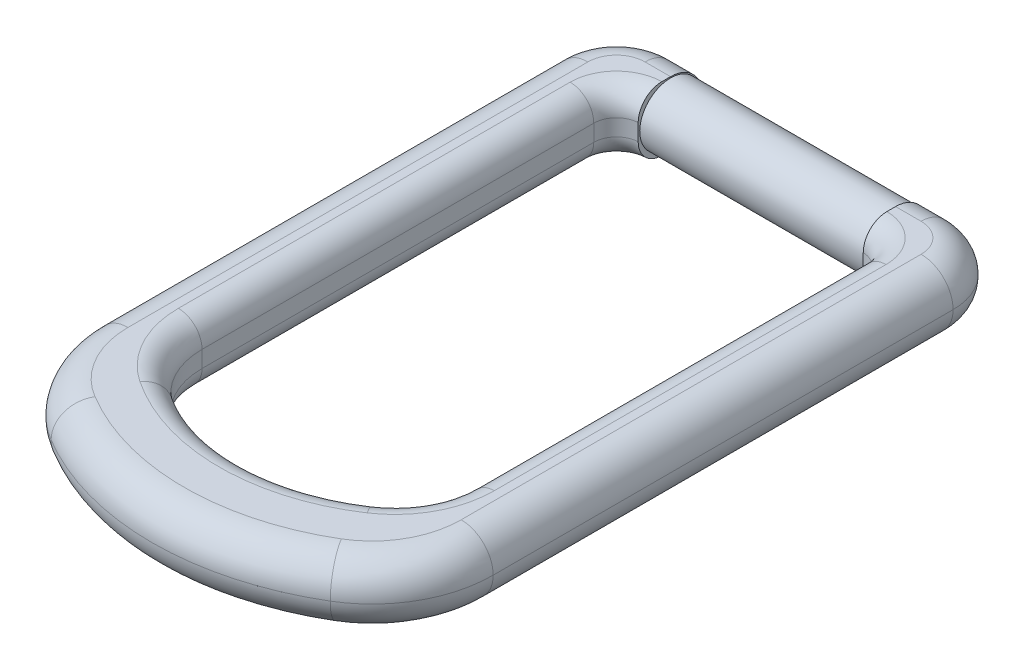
ISO-10303-21;
HEADER;
FILE_DESCRIPTION(('STEP AP214'),'2;1');
FILE_NAME('part.step','',(''),(''),'','','');
FILE_SCHEMA(('AUTOMOTIVE_DESIGN { 1 0 10303 214 1 1 1 1 }'));
ENDSEC;
DATA;
#1=APPLICATION_CONTEXT('core data for automotive mechanical design processes');
#2=APPLICATION_PROTOCOL_DEFINITION('international standard','automotive_design',2000,#1);
#3=PRODUCT_CONTEXT('',#1,'mechanical');
#4=PRODUCT('Part','Part','',(#3));
#5=PRODUCT_RELATED_PRODUCT_CATEGORY('part','',(#4));
#6=PRODUCT_DEFINITION_FORMATION('','',#4);
#7=PRODUCT_DEFINITION_CONTEXT('part definition',#1,'design');
#8=PRODUCT_DEFINITION('design','',#6,#7);
#9=PRODUCT_DEFINITION_SHAPE('','',#8);
#10=(LENGTH_UNIT() NAMED_UNIT(*) SI_UNIT(.MILLI.,.METRE.));
#11=(NAMED_UNIT(*) PLANE_ANGLE_UNIT() SI_UNIT($,.RADIAN.));
#12=(NAMED_UNIT(*) SI_UNIT($,.STERADIAN.) SOLID_ANGLE_UNIT());
#13=UNCERTAINTY_MEASURE_WITH_UNIT(LENGTH_MEASURE(1.E-05),#10,'distance_accuracy_value','');
#14=(GEOMETRIC_REPRESENTATION_CONTEXT(3) GLOBAL_UNCERTAINTY_ASSIGNED_CONTEXT((#13)) GLOBAL_UNIT_ASSIGNED_CONTEXT((#10,
#11,#12)) REPRESENTATION_CONTEXT('',''));
#15=CARTESIAN_POINT('',(0.,0.,0.));
#16=DIRECTION('',(0.,0.,1.));
#17=DIRECTION('',(1.,0.,0.));
#18=AXIS2_PLACEMENT_3D('',#15,#16,#17);
#19=CARTESIAN_POINT('',(47.0995210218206,13.5,23.2216604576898));
#20=DIRECTION('',(0.,-1.,0.));
#21=DIRECTION('',(0.,0.,-1.));
#22=AXIS2_PLACEMENT_3D('',#19,#20,#21);
#23=CYLINDRICAL_SURFACE('',#22,9.57956359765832);
#24=DIRECTION('',(0.,-1.,0.));
#25=VECTOR('',#24,1.);
#26=CARTESIAN_POINT('',(47.5,13.5,13.650471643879));
#27=LINE('',#26,#25);
#28=CARTESIAN_POINT('',(47.5,3.5,13.650471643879));
#29=VERTEX_POINT('',#28);
#30=CARTESIAN_POINT('',(47.5,-3.5,13.650471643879));
#31=VERTEX_POINT('',#30);
#32=EDGE_CURVE('E527',#29,#31,#27,.T.);
#33=ORIENTED_EDGE('',*,*,#32,.T.);
#34=CARTESIAN_POINT('',(47.0995210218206,-3.5,23.2216604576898));
#35=DIRECTION('',(0.,1.,0.));
#36=DIRECTION('',(0.,0.,1.));
#37=AXIS2_PLACEMENT_3D('',#34,#35,#36);
#38=CIRCLE('',#37,9.57956359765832);
#39=CARTESIAN_POINT('',(56.6790846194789,-3.5,23.2216604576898));
#40=VERTEX_POINT('',#39);
#41=EDGE_CURVE('E29',#31,#40,#38,.F.);
#42=ORIENTED_EDGE('',*,*,#41,.T.);
#43=DIRECTION('',(0.,-1.,0.));
#44=VECTOR('',#43,1.);
#45=CARTESIAN_POINT('',(56.6790846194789,13.5,23.2216604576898));
#46=LINE('',#45,#44);
#47=CARTESIAN_POINT('',(56.6790846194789,3.5,23.2216604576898));
#48=VERTEX_POINT('',#47);
#49=EDGE_CURVE('E525',#48,#40,#46,.T.);
#50=ORIENTED_EDGE('',*,*,#49,.F.);
#51=CARTESIAN_POINT('',(47.0995210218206,3.5,23.2216604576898));
#52=DIRECTION('',(0.,1.,0.));
#53=DIRECTION('',(0.,0.,1.));
#54=AXIS2_PLACEMENT_3D('',#51,#52,#53);
#55=CIRCLE('',#54,9.57956359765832);
#56=EDGE_CURVE('E595',#48,#29,#55,.T.);
#57=ORIENTED_EDGE('',*,*,#56,.T.);
#58=EDGE_LOOP('',(#33,#42,#50,#57));
#59=FACE_BOUND('',#58,.T.);
#60=ADVANCED_FACE('F14',(#59),#23,.F.);
#61=CARTESIAN_POINT('',(56.6790846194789,13.5,23.2216604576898));
#62=DIRECTION('',(1.,0.,0.));
#63=DIRECTION('',(0.,0.,-1.));
#64=AXIS2_PLACEMENT_3D('',#61,#62,#63);
#65=PLANE('',#64);
#66=ORIENTED_EDGE('',*,*,#49,.T.);
#67=DIRECTION('',(0.,0.,1.));
#68=VECTOR('',#67,1.);
#69=CARTESIAN_POINT('',(56.6790846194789,-3.5,23.2216604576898));
#70=LINE('',#69,#68);
#71=CARTESIAN_POINT('',(56.6790846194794,-3.5,188.577776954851));
#72=VERTEX_POINT('',#71);
#73=EDGE_CURVE('E36',#40,#72,#70,.T.);
#74=ORIENTED_EDGE('',*,*,#73,.T.);
#75=DIRECTION('',(0.,-1.,0.));
#76=VECTOR('',#75,1.);
#77=CARTESIAN_POINT('',(56.6790846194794,13.5,188.577776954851));
#78=LINE('',#77,#76);
#79=CARTESIAN_POINT('',(56.6790846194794,3.5,188.577776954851));
#80=VERTEX_POINT('',#79);
#81=EDGE_CURVE('E523',#80,#72,#78,.T.);
#82=ORIENTED_EDGE('',*,*,#81,.F.);
#83=DIRECTION('',(0.,0.,1.));
#84=VECTOR('',#83,1.);
#85=CARTESIAN_POINT('',(56.6790846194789,3.5,23.2216604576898));
#86=LINE('',#85,#84);
#87=EDGE_CURVE('E598',#80,#48,#86,.F.);
#88=ORIENTED_EDGE('',*,*,#87,.T.);
#89=EDGE_LOOP('',(#66,#74,#82,#88));
#90=FACE_BOUND('',#89,.T.);
#91=ADVANCED_FACE('F366',(#90),#65,.F.);
#92=CARTESIAN_POINT('',(24.7472059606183,13.5,188.577776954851));
#93=DIRECTION('',(0.,-1.,0.));
#94=DIRECTION('',(0.,0.,-1.));
#95=AXIS2_PLACEMENT_3D('',#92,#93,#94);
#96=CYLINDRICAL_SURFACE('',#95,31.9318786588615);
#97=ORIENTED_EDGE('',*,*,#81,.T.);
#98=CARTESIAN_POINT('',(24.7472059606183,-3.5,188.577776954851));
#99=DIRECTION('',(0.,1.,0.));
#100=DIRECTION('',(0.,0.,1.));
#101=AXIS2_PLACEMENT_3D('',#98,#99,#100);
#102=CIRCLE('',#101,31.9318786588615);
#103=CARTESIAN_POINT('',(42.4237816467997,-3.5,215.170699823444));
#104=VERTEX_POINT('',#103);
#105=EDGE_CURVE('E258',#72,#104,#102,.F.);
#106=ORIENTED_EDGE('',*,*,#105,.T.);
#107=DIRECTION('',(0.,-1.,0.));
#108=VECTOR('',#107,1.);
#109=CARTESIAN_POINT('',(42.4237816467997,13.5,215.170699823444));
#110=LINE('',#109,#108);
#111=CARTESIAN_POINT('',(42.4237816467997,3.5,215.170699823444));
#112=VERTEX_POINT('',#111);
#113=EDGE_CURVE('E520',#112,#104,#110,.T.);
#114=ORIENTED_EDGE('',*,*,#113,.F.);
#115=CARTESIAN_POINT('',(24.7472059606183,3.5,188.577776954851));
#116=DIRECTION('',(0.,1.,0.));
#117=DIRECTION('',(0.,0.,1.));
#118=AXIS2_PLACEMENT_3D('',#115,#116,#117);
#119=CIRCLE('',#118,31.9318786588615);
#120=EDGE_CURVE('E463',#112,#80,#119,.T.);
#121=ORIENTED_EDGE('',*,*,#120,.T.);
#122=EDGE_LOOP('',(#97,#106,#114,#121));
#123=FACE_BOUND('',#122,.T.);
#124=ADVANCED_FACE('F369',(#123),#96,.F.);
#125=CARTESIAN_POINT('',(8.60422844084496E-13,13.5,151.347684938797));
#126=DIRECTION('',(0.,-1.,0.));
#127=DIRECTION('',(0.,0.,-1.));
#128=AXIS2_PLACEMENT_3D('',#125,#126,#127);
#129=CYLINDRICAL_SURFACE('',#128,76.6365087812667);
#130=ORIENTED_EDGE('',*,*,#113,.T.);
#131=CARTESIAN_POINT('',(8.60422844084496E-13,-3.5,151.347684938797));
#132=DIRECTION('',(0.,1.,0.));
#133=DIRECTION('',(0.,0.,1.));
#134=AXIS2_PLACEMENT_3D('',#131,#132,#133);
#135=CIRCLE('',#134,76.6365087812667);
#136=CARTESIAN_POINT('',(-42.4237816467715,-3.5,215.170699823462));
#137=VERTEX_POINT('',#136);
#138=EDGE_CURVE('E256',#104,#137,#135,.F.);
#139=ORIENTED_EDGE('',*,*,#138,.T.);
#140=DIRECTION('',(0.,-1.,0.));
#141=VECTOR('',#140,1.);
#142=CARTESIAN_POINT('',(-42.4237816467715,13.5,215.170699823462));
#143=LINE('',#142,#141);
#144=CARTESIAN_POINT('',(-42.4237816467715,3.5,215.170699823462));
#145=VERTEX_POINT('',#144);
#146=EDGE_CURVE('E517',#145,#137,#143,.T.);
#147=ORIENTED_EDGE('',*,*,#146,.F.);
#148=CARTESIAN_POINT('',(8.60422844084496E-13,3.5,151.347684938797));
#149=DIRECTION('',(0.,1.,0.));
#150=DIRECTION('',(0.,0.,1.));
#151=AXIS2_PLACEMENT_3D('',#148,#149,#150);
#152=CIRCLE('',#151,76.6365087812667);
#153=EDGE_CURVE('E601',#145,#112,#152,.T.);
#154=ORIENTED_EDGE('',*,*,#153,.T.);
#155=EDGE_LOOP('',(#130,#139,#147,#154));
#156=FACE_BOUND('',#155,.T.);
#157=ADVANCED_FACE('F372',(#156),#129,.F.);
#158=CARTESIAN_POINT('',(-24.7472059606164,13.5,188.577776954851));
#159=DIRECTION('',(0.,-1.,0.));
#160=DIRECTION('',(0.,0.,-1.));
#161=AXIS2_PLACEMENT_3D('',#158,#159,#160);
#162=CYLINDRICAL_SURFACE('',#161,31.9318786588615);
#163=ORIENTED_EDGE('',*,*,#146,.T.);
#164=CARTESIAN_POINT('',(-24.7472059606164,-3.5,188.577776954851));
#165=DIRECTION('',(0.,1.,0.));
#166=DIRECTION('',(0.,0.,1.));
#167=AXIS2_PLACEMENT_3D('',#164,#165,#166);
#168=CIRCLE('',#167,31.9318786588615);
#169=CARTESIAN_POINT('',(-56.6790846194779,-3.5,188.577776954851));
#170=VERTEX_POINT('',#169);
#171=EDGE_CURVE('E249',#137,#170,#168,.F.);
#172=ORIENTED_EDGE('',*,*,#171,.T.);
#173=DIRECTION('',(0.,-1.,0.));
#174=VECTOR('',#173,1.);
#175=CARTESIAN_POINT('',(-56.6790846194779,13.5,188.577776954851));
#176=LINE('',#175,#174);
#177=CARTESIAN_POINT('',(-56.6790846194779,3.5,188.577776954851));
#178=VERTEX_POINT('',#177);
#179=EDGE_CURVE('E514',#178,#170,#176,.T.);
#180=ORIENTED_EDGE('',*,*,#179,.F.);
#181=CARTESIAN_POINT('',(-24.7472059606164,3.5,188.577776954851));
#182=DIRECTION('',(0.,1.,0.));
#183=DIRECTION('',(0.,0.,1.));
#184=AXIS2_PLACEMENT_3D('',#181,#182,#183);
#185=CIRCLE('',#184,31.9318786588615);
#186=EDGE_CURVE('E603',#178,#145,#185,.T.);
#187=ORIENTED_EDGE('',*,*,#186,.T.);
#188=EDGE_LOOP('',(#163,#172,#180,#187));
#189=FACE_BOUND('',#188,.T.);
#190=ADVANCED_FACE('F376',(#189),#162,.F.);
#191=CARTESIAN_POINT('',(-56.679084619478,13.5,23.2216604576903));
#192=DIRECTION('',(-1.,0.,0.));
#193=DIRECTION('',(0.,0.,1.));
#194=AXIS2_PLACEMENT_3D('',#191,#192,#193);
#195=PLANE('',#194);
#196=ORIENTED_EDGE('',*,*,#179,.T.);
#197=DIRECTION('',(0.,0.,-1.));
#198=VECTOR('',#197,1.);
#199=CARTESIAN_POINT('',(-56.679084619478,-3.5,23.2216604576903));
#200=LINE('',#199,#198);
#201=CARTESIAN_POINT('',(-56.679084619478,-3.5,23.2216604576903));
#202=VERTEX_POINT('',#201);
#203=EDGE_CURVE('E246',#170,#202,#200,.T.);
#204=ORIENTED_EDGE('',*,*,#203,.T.);
#205=DIRECTION('',(0.,-1.,0.));
#206=VECTOR('',#205,1.);
#207=CARTESIAN_POINT('',(-56.679084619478,13.5,23.2216604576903));
#208=LINE('',#207,#206);
#209=CARTESIAN_POINT('',(-56.679084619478,3.5,23.2216604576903));
#210=VERTEX_POINT('',#209);
#211=EDGE_CURVE('E511',#210,#202,#208,.T.);
#212=ORIENTED_EDGE('',*,*,#211,.F.);
#213=DIRECTION('',(0.,0.,-1.));
#214=VECTOR('',#213,1.);
#215=CARTESIAN_POINT('',(-56.6790846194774,3.5,188.577776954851));
#216=LINE('',#215,#214);
#217=EDGE_CURVE('E604',#210,#178,#216,.F.);
#218=ORIENTED_EDGE('',*,*,#217,.T.);
#219=EDGE_LOOP('',(#196,#204,#212,#218));
#220=FACE_BOUND('',#219,.T.);
#221=ADVANCED_FACE('F380',(#220),#195,.F.);
#222=CARTESIAN_POINT('',(-47.0995210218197,13.5,23.2216604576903));
#223=DIRECTION('',(0.,-1.,0.));
#224=DIRECTION('',(0.,0.,-1.));
#225=AXIS2_PLACEMENT_3D('',#222,#223,#224);
#226=CYLINDRICAL_SURFACE('',#225,9.57956359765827);
#227=ORIENTED_EDGE('',*,*,#211,.T.);
#228=CARTESIAN_POINT('',(-47.0995210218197,-3.5,23.2216604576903));
#229=DIRECTION('',(0.,1.,0.));
#230=DIRECTION('',(0.,0.,1.));
#231=AXIS2_PLACEMENT_3D('',#228,#229,#230);
#232=CIRCLE('',#231,9.57956359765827);
#233=CARTESIAN_POINT('',(-47.5,-3.5,13.6504716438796));
#234=VERTEX_POINT('',#233);
#235=EDGE_CURVE('E637',#202,#234,#232,.F.);
#236=ORIENTED_EDGE('',*,*,#235,.T.);
#237=DIRECTION('',(0.,-1.,0.));
#238=VECTOR('',#237,1.);
#239=CARTESIAN_POINT('',(-47.5,13.5,13.6504716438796));
#240=LINE('',#239,#238);
#241=CARTESIAN_POINT('',(-47.5,3.5,13.6504716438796));
#242=VERTEX_POINT('',#241);
#243=EDGE_CURVE('E225',#242,#234,#240,.T.);
#244=ORIENTED_EDGE('',*,*,#243,.F.);
#245=CARTESIAN_POINT('',(-47.0995210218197,3.5,23.2216604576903));
#246=DIRECTION('',(0.,1.,0.));
#247=DIRECTION('',(0.,0.,1.));
#248=AXIS2_PLACEMENT_3D('',#245,#246,#247);
#249=CIRCLE('',#248,9.57956359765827);
#250=EDGE_CURVE('E353',#242,#210,#249,.T.);
#251=ORIENTED_EDGE('',*,*,#250,.T.);
#252=EDGE_LOOP('',(#227,#236,#244,#251));
#253=FACE_BOUND('',#252,.T.);
#254=ADVANCED_FACE('F384',(#253),#226,.F.);
#255=CARTESIAN_POINT('',(-58.2756785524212,13.5,12.0455029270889));
#256=DIRECTION('',(0.,1.,0.));
#257=DIRECTION('',(0.,0.,1.));
#258=AXIS2_PLACEMENT_3D('',#255,#256,#257);
#259=PLANE('',#258);
#260=DIRECTION('',(0.,0.,1.));
#261=VECTOR('',#260,1.);
#262=CARTESIAN_POINT('',(47.5,13.5,12.9926822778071));
#263=LINE('',#262,#261);
#264=CARTESIAN_POINT('',(47.5,13.5,-4.02455846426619E-13));
#265=VERTEX_POINT('',#264);
#266=CARTESIAN_POINT('',(47.5,13.5,3.646192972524));
#267=VERTEX_POINT('',#266);
#268=EDGE_CURVE('E507',#265,#267,#263,.T.);
#269=ORIENTED_EDGE('',*,*,#268,.T.);
#270=CARTESIAN_POINT('',(47.0995210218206,13.5,23.2216604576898));
#271=DIRECTION('',(0.,1.,0.));
#272=DIRECTION('',(0.,0.,1.));
#273=AXIS2_PLACEMENT_3D('',#270,#271,#272);
#274=CIRCLE('',#273,19.5795635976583);
#275=CARTESIAN_POINT('',(66.6790846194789,13.5,23.2216604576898));
#276=VERTEX_POINT('',#275);
#277=EDGE_CURVE('E592',#267,#276,#274,.F.);
#278=ORIENTED_EDGE('',*,*,#277,.T.);
#279=DIRECTION('',(0.,0.,1.));
#280=VECTOR('',#279,1.);
#281=CARTESIAN_POINT('',(66.6790846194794,13.5,188.577776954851));
#282=LINE('',#281,#280);
#283=CARTESIAN_POINT('',(66.6790846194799,13.5,188.577776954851));
#284=VERTEX_POINT('',#283);
#285=EDGE_CURVE('E590',#276,#284,#282,.T.);
#286=ORIENTED_EDGE('',*,*,#285,.T.);
#287=CARTESIAN_POINT('',(24.7472059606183,13.5,188.577776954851));
#288=DIRECTION('',(0.,1.,0.));
#289=DIRECTION('',(0.,0.,1.));
#290=AXIS2_PLACEMENT_3D('',#287,#288,#289);
#291=CIRCLE('',#290,41.9318786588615);
#292=CARTESIAN_POINT('',(47.9594959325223,13.5,223.498716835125));
#293=VERTEX_POINT('',#292);
#294=EDGE_CURVE('E461',#284,#293,#291,.F.);
#295=ORIENTED_EDGE('',*,*,#294,.T.);
#296=CARTESIAN_POINT('',(8.60422844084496E-13,13.5,151.347684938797));
#297=DIRECTION('',(0.,1.,0.));
#298=DIRECTION('',(0.,0.,1.));
#299=AXIS2_PLACEMENT_3D('',#296,#297,#298);
#300=CIRCLE('',#299,86.6365087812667);
#301=CARTESIAN_POINT('',(-47.9594959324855,13.5,223.498716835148));
#302=VERTEX_POINT('',#301);
#303=EDGE_CURVE('E587',#293,#302,#300,.F.);
#304=ORIENTED_EDGE('',*,*,#303,.T.);
#305=CARTESIAN_POINT('',(-24.7472059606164,13.5,188.577776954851));
#306=DIRECTION('',(0.,1.,0.));
#307=DIRECTION('',(0.,0.,1.));
#308=AXIS2_PLACEMENT_3D('',#305,#306,#307);
#309=CIRCLE('',#308,41.9318786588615);
#310=CARTESIAN_POINT('',(-66.6790846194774,13.5,188.577776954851));
#311=VERTEX_POINT('',#310);
#312=EDGE_CURVE('E585',#302,#311,#309,.F.);
#313=ORIENTED_EDGE('',*,*,#312,.T.);
#314=DIRECTION('',(0.,0.,-1.));
#315=VECTOR('',#314,1.);
#316=CARTESIAN_POINT('',(-66.679084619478,13.5,23.2216604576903));
#317=LINE('',#316,#315);
#318=CARTESIAN_POINT('',(-66.679084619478,13.5,23.2216604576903));
#319=VERTEX_POINT('',#318);
#320=EDGE_CURVE('E583',#311,#319,#317,.T.);
#321=ORIENTED_EDGE('',*,*,#320,.T.);
#322=CARTESIAN_POINT('',(-47.0995210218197,13.5,23.2216604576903));
#323=DIRECTION('',(0.,1.,0.));
#324=DIRECTION('',(0.,0.,1.));
#325=AXIS2_PLACEMENT_3D('',#322,#323,#324);
#326=CIRCLE('',#325,19.5795635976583);
#327=CARTESIAN_POINT('',(-47.5,13.5,3.64619297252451));
#328=VERTEX_POINT('',#327);
#329=EDGE_CURVE('E580',#319,#328,#326,.F.);
#330=ORIENTED_EDGE('',*,*,#329,.T.);
#331=DIRECTION('',(0.,0.,-1.));
#332=VECTOR('',#331,1.);
#333=CARTESIAN_POINT('',(-47.5,13.5,13.6504716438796));
#334=LINE('',#333,#332);
#335=CARTESIAN_POINT('',(-47.5,13.5,0.));
#336=VERTEX_POINT('',#335);
#337=EDGE_CURVE('E504',#328,#336,#334,.T.);
#338=ORIENTED_EDGE('',*,*,#337,.T.);
#339=DIRECTION('',(-1.,0.,0.));
#340=VECTOR('',#339,1.);
#341=CARTESIAN_POINT('',(-58.2756785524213,13.5,0.));
#342=LINE('',#341,#340);
#343=CARTESIAN_POINT('',(-58.2756785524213,13.5,0.));
#344=VERTEX_POINT('',#343);
#345=EDGE_CURVE('E546',#336,#344,#342,.T.);
#346=ORIENTED_EDGE('',*,*,#345,.T.);
#347=CARTESIAN_POINT('',(-58.2756785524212,13.5,12.0455029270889));
#348=DIRECTION('',(0.,1.,0.));
#349=DIRECTION('',(0.,0.,1.));
#350=AXIS2_PLACEMENT_3D('',#347,#348,#349);
#351=CIRCLE('',#350,12.0455029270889);
#352=CARTESIAN_POINT('',(-70.32118147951,13.5,12.0455029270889));
#353=VERTEX_POINT('',#352);
#354=EDGE_CURVE('E531',#344,#353,#351,.T.);
#355=ORIENTED_EDGE('',*,*,#354,.T.);
#356=DIRECTION('',(0.,0.,1.));
#357=VECTOR('',#356,1.);
#358=CARTESIAN_POINT('',(-70.3211814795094,13.5,206.186677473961));
#359=LINE('',#358,#357);
#360=CARTESIAN_POINT('',(-70.3211814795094,13.5,206.186677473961));
#361=VERTEX_POINT('',#360);
#362=EDGE_CURVE('E529',#353,#361,#359,.T.);
#363=ORIENTED_EDGE('',*,*,#362,.T.);
#364=CARTESIAN_POINT('',(-32.7301756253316,13.5,206.186677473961));
#365=DIRECTION('',(0.,1.,0.));
#366=DIRECTION('',(0.,0.,1.));
#367=AXIS2_PLACEMENT_3D('',#364,#365,#366);
#368=CIRCLE('',#367,37.5910058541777);
#369=CARTESIAN_POINT('',(-51.9955661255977,13.5,238.465593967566));
#370=VERTEX_POINT('',#369);
#371=EDGE_CURVE('E533',#361,#370,#368,.T.);
#372=ORIENTED_EDGE('',*,*,#371,.T.);
#373=CARTESIAN_POINT('',(8.60422844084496E-13,13.5,151.347684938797));
#374=DIRECTION('',(0.,1.,0.));
#375=DIRECTION('',(0.,0.,1.));
#376=AXIS2_PLACEMENT_3D('',#373,#374,#375);
#377=CIRCLE('',#376,101.4547631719);
#378=CARTESIAN_POINT('',(51.9955661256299,13.5,238.465593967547));
#379=VERTEX_POINT('',#378);
#380=EDGE_CURVE('E535',#370,#379,#377,.T.);
#381=ORIENTED_EDGE('',*,*,#380,.T.);
#382=CARTESIAN_POINT('',(32.7301756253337,13.5,206.186677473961));
#383=DIRECTION('',(0.,1.,0.));
#384=DIRECTION('',(0.,0.,1.));
#385=AXIS2_PLACEMENT_3D('',#382,#383,#384);
#386=CIRCLE('',#385,37.5910058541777);
#387=CARTESIAN_POINT('',(70.3211814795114,13.5,206.186677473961));
#388=VERTEX_POINT('',#387);
#389=EDGE_CURVE('E537',#379,#388,#386,.T.);
#390=ORIENTED_EDGE('',*,*,#389,.T.);
#391=DIRECTION('',(0.,0.,-1.));
#392=VECTOR('',#391,1.);
#393=CARTESIAN_POINT('',(70.3211814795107,13.5,12.0455029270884));
#394=LINE('',#393,#392);
#395=CARTESIAN_POINT('',(70.3211814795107,13.5,12.0455029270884));
#396=VERTEX_POINT('',#395);
#397=EDGE_CURVE('E539',#388,#396,#394,.T.);
#398=ORIENTED_EDGE('',*,*,#397,.T.);
#399=CARTESIAN_POINT('',(58.2756785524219,13.5,12.0455029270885));
#400=DIRECTION('',(0.,1.,0.));
#401=DIRECTION('',(0.,0.,1.));
#402=AXIS2_PLACEMENT_3D('',#399,#400,#401);
#403=CIRCLE('',#402,12.0455029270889);
#404=CARTESIAN_POINT('',(58.2756785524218,13.5,-4.02455846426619E-13));
#405=VERTEX_POINT('',#404);
#406=EDGE_CURVE('E541',#396,#405,#403,.T.);
#407=ORIENTED_EDGE('',*,*,#406,.T.);
#408=DIRECTION('',(-1.,0.,0.));
#409=VECTOR('',#408,1.);
#410=CARTESIAN_POINT('',(47.5,13.5,-4.02455846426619E-13));
#411=LINE('',#410,#409);
#412=EDGE_CURVE('E543',#405,#265,#411,.T.);
#413=ORIENTED_EDGE('',*,*,#412,.T.);
#414=EDGE_LOOP('',(#269,#278,#286,#295,#304,#313,#321,#330,#338,#346,#355,#363,#372,#381,#390,
#398,#407,#413));
#415=FACE_BOUND('',#414,.T.);
#416=ADVANCED_FACE('F388',(#415),#259,.T.);
#417=CARTESIAN_POINT('',(-58.2756785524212,-13.5,12.0455029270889));
#418=DIRECTION('',(0.,1.,0.));
#419=DIRECTION('',(0.,0.,1.));
#420=AXIS2_PLACEMENT_3D('',#417,#418,#419);
#421=PLANE('',#420);
#422=DIRECTION('',(0.,0.,-1.));
#423=VECTOR('',#422,1.);
#424=CARTESIAN_POINT('',(-47.5,-13.5,-13.5));
#425=LINE('',#424,#423);
#426=CARTESIAN_POINT('',(-47.5,-13.5,3.64619297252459));
#427=VERTEX_POINT('',#426);
#428=CARTESIAN_POINT('',(-47.5,-13.5,-4.02455846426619E-13));
#429=VERTEX_POINT('',#428);
#430=EDGE_CURVE('E222',#427,#429,#425,.T.);
#431=ORIENTED_EDGE('',*,*,#430,.F.);
#432=CARTESIAN_POINT('',(-47.0995210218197,-13.5,23.2216604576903));
#433=DIRECTION('',(0.,1.,0.));
#434=DIRECTION('',(0.,0.,1.));
#435=AXIS2_PLACEMENT_3D('',#432,#433,#434);
#436=CIRCLE('',#435,19.5795635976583);
#437=CARTESIAN_POINT('',(-66.679084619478,-13.5,23.2216604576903));
#438=VERTEX_POINT('',#437);
#439=EDGE_CURVE('E234',#427,#438,#436,.T.);
#440=ORIENTED_EDGE('',*,*,#439,.T.);
#441=DIRECTION('',(0.,0.,-1.));
#442=VECTOR('',#441,1.);
#443=CARTESIAN_POINT('',(-66.679084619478,-13.5,12.0455029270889));
#444=LINE('',#443,#442);
#445=CARTESIAN_POINT('',(-66.6790846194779,-13.5,188.577776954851));
#446=VERTEX_POINT('',#445);
#447=EDGE_CURVE('E247',#438,#446,#444,.F.);
#448=ORIENTED_EDGE('',*,*,#447,.T.);
#449=CARTESIAN_POINT('',(-24.7472059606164,-13.5,188.577776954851));
#450=DIRECTION('',(0.,1.,0.));
#451=DIRECTION('',(0.,0.,1.));
#452=AXIS2_PLACEMENT_3D('',#449,#450,#451);
#453=CIRCLE('',#452,41.9318786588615);
#454=CARTESIAN_POINT('',(-47.9594959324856,-13.5,223.498716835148));
#455=VERTEX_POINT('',#454);
#456=EDGE_CURVE('E251',#446,#455,#453,.T.);
#457=ORIENTED_EDGE('',*,*,#456,.T.);
#458=CARTESIAN_POINT('',(8.60422844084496E-13,-13.5,151.347684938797));
#459=DIRECTION('',(0.,1.,0.));
#460=DIRECTION('',(0.,0.,1.));
#461=AXIS2_PLACEMENT_3D('',#458,#459,#460);
#462=CIRCLE('',#461,86.6365087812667);
#463=CARTESIAN_POINT('',(47.9594959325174,-13.5,223.498716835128));
#464=VERTEX_POINT('',#463);
#465=EDGE_CURVE('E629',#455,#464,#462,.T.);
#466=ORIENTED_EDGE('',*,*,#465,.T.);
#467=CARTESIAN_POINT('',(24.7472059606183,-13.5,188.577776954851));
#468=DIRECTION('',(0.,1.,0.));
#469=DIRECTION('',(0.,0.,1.));
#470=AXIS2_PLACEMENT_3D('',#467,#468,#469);
#471=CIRCLE('',#470,41.9318786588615);
#472=CARTESIAN_POINT('',(66.6790846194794,-13.5,188.577776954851));
#473=VERTEX_POINT('',#472);
#474=EDGE_CURVE('E649',#464,#473,#471,.T.);
#475=ORIENTED_EDGE('',*,*,#474,.T.);
#476=DIRECTION('',(0.,0.,1.));
#477=VECTOR('',#476,1.);
#478=CARTESIAN_POINT('',(66.6790846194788,-13.5,12.0455029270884));
#479=LINE('',#478,#477);
#480=CARTESIAN_POINT('',(66.6790846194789,-13.5,23.2216604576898));
#481=VERTEX_POINT('',#480);
#482=EDGE_CURVE('E642',#473,#481,#479,.F.);
#483=ORIENTED_EDGE('',*,*,#482,.T.);
#484=CARTESIAN_POINT('',(47.0995210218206,-13.5,23.2216604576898));
#485=DIRECTION('',(0.,1.,0.));
#486=DIRECTION('',(0.,0.,1.));
#487=AXIS2_PLACEMENT_3D('',#484,#485,#486);
#488=CIRCLE('',#487,19.5795635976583);
#489=CARTESIAN_POINT('',(47.5,-13.5,3.646192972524));
#490=VERTEX_POINT('',#489);
#491=EDGE_CURVE('E638',#481,#490,#488,.T.);
#492=ORIENTED_EDGE('',*,*,#491,.T.);
#493=DIRECTION('',(0.,0.,1.));
#494=VECTOR('',#493,1.);
#495=CARTESIAN_POINT('',(47.5,-13.5,13.650471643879));
#496=LINE('',#495,#494);
#497=CARTESIAN_POINT('',(47.5,-13.5,-4.02455846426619E-13));
#498=VERTEX_POINT('',#497);
#499=EDGE_CURVE('E239',#498,#490,#496,.T.);
#500=ORIENTED_EDGE('',*,*,#499,.F.);
#501=DIRECTION('',(-1.,0.,0.));
#502=VECTOR('',#501,1.);
#503=CARTESIAN_POINT('',(-58.2756785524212,-13.5,-4.02455846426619E-13));
#504=LINE('',#503,#502);
#505=CARTESIAN_POINT('',(58.2756785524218,-13.5,-4.02455846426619E-13));
#506=VERTEX_POINT('',#505);
#507=EDGE_CURVE('E981',#498,#506,#504,.F.);
#508=ORIENTED_EDGE('',*,*,#507,.T.);
#509=CARTESIAN_POINT('',(58.2756785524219,-13.5,12.0455029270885));
#510=DIRECTION('',(0.,1.,0.));
#511=DIRECTION('',(0.,0.,1.));
#512=AXIS2_PLACEMENT_3D('',#509,#510,#511);
#513=CIRCLE('',#512,12.0455029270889);
#514=CARTESIAN_POINT('',(70.3211814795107,-13.5,12.0455029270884));
#515=VERTEX_POINT('',#514);
#516=EDGE_CURVE('E985',#506,#515,#513,.F.);
#517=ORIENTED_EDGE('',*,*,#516,.T.);
#518=DIRECTION('',(0.,0.,-1.));
#519=VECTOR('',#518,1.);
#520=CARTESIAN_POINT('',(70.3211814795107,-13.5,12.0455029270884));
#521=LINE('',#520,#519);
#522=CARTESIAN_POINT('',(70.3211814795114,-13.5,206.186677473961));
#523=VERTEX_POINT('',#522);
#524=EDGE_CURVE('E986',#515,#523,#521,.F.);
#525=ORIENTED_EDGE('',*,*,#524,.T.);
#526=CARTESIAN_POINT('',(32.7301756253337,-13.5,206.186677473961));
#527=DIRECTION('',(0.,1.,0.));
#528=DIRECTION('',(0.,0.,1.));
#529=AXIS2_PLACEMENT_3D('',#526,#527,#528);
#530=CIRCLE('',#529,37.5910058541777);
#531=CARTESIAN_POINT('',(51.995566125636,-13.5,238.465593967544));
#532=VERTEX_POINT('',#531);
#533=EDGE_CURVE('E990',#523,#532,#530,.F.);
#534=ORIENTED_EDGE('',*,*,#533,.T.);
#535=CARTESIAN_POINT('',(8.60422844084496E-13,-13.5,151.347684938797));
#536=DIRECTION('',(0.,1.,0.));
#537=DIRECTION('',(0.,0.,1.));
#538=AXIS2_PLACEMENT_3D('',#535,#536,#537);
#539=CIRCLE('',#538,101.4547631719);
#540=CARTESIAN_POINT('',(-51.9955661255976,-13.5,238.465593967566));
#541=VERTEX_POINT('',#540);
#542=EDGE_CURVE('E992',#532,#541,#539,.F.);
#543=ORIENTED_EDGE('',*,*,#542,.T.);
#544=CARTESIAN_POINT('',(-32.7301756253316,-13.5,206.186677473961));
#545=DIRECTION('',(0.,1.,0.));
#546=DIRECTION('',(0.,0.,1.));
#547=AXIS2_PLACEMENT_3D('',#544,#545,#546);
#548=CIRCLE('',#547,37.5910058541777);
#549=CARTESIAN_POINT('',(-70.3211814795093,-13.5,206.186677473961));
#550=VERTEX_POINT('',#549);
#551=EDGE_CURVE('E994',#541,#550,#548,.F.);
#552=ORIENTED_EDGE('',*,*,#551,.T.);
#553=DIRECTION('',(0.,0.,1.));
#554=VECTOR('',#553,1.);
#555=CARTESIAN_POINT('',(-70.32118147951,-13.5,12.0455029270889));
#556=LINE('',#555,#554);
#557=CARTESIAN_POINT('',(-70.32118147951,-13.5,12.0455029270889));
#558=VERTEX_POINT('',#557);
#559=EDGE_CURVE('E996',#550,#558,#556,.F.);
#560=ORIENTED_EDGE('',*,*,#559,.T.);
#561=CARTESIAN_POINT('',(-58.2756785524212,-13.5,12.0455029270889));
#562=DIRECTION('',(0.,1.,0.));
#563=DIRECTION('',(0.,0.,1.));
#564=AXIS2_PLACEMENT_3D('',#561,#562,#563);
#565=CIRCLE('',#564,12.0455029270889);
#566=CARTESIAN_POINT('',(-58.2756785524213,-13.5,0.));
#567=VERTEX_POINT('',#566);
#568=EDGE_CURVE('E998',#558,#567,#565,.F.);
#569=ORIENTED_EDGE('',*,*,#568,.T.);
#570=DIRECTION('',(-1.,0.,0.));
#571=VECTOR('',#570,1.);
#572=CARTESIAN_POINT('',(-58.2756785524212,-13.5,0.));
#573=LINE('',#572,#571);
#574=EDGE_CURVE('E237',#567,#429,#573,.F.);
#575=ORIENTED_EDGE('',*,*,#574,.T.);
#576=EDGE_LOOP('',(#431,#440,#448,#457,#466,#475,#483,#492,#500,#508,#517,#525,#534,#543,#552,
#560,#569,#575));
#577=FACE_BOUND('',#576,.T.);
#578=ADVANCED_FACE('F233',(#577),#421,.F.);
#579=CARTESIAN_POINT('',(-58.2756785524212,0.,-4.02455846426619E-13));
#580=DIRECTION('',(1.,0.,0.));
#581=DIRECTION('',(0.,0.,-1.));
#582=AXIS2_PLACEMENT_3D('',#579,#580,#581);
#583=CYLINDRICAL_SURFACE('',#582,13.5);
#584=CARTESIAN_POINT('',(47.5,0.,-4.02455846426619E-13));
#585=DIRECTION('',(-1.,0.,0.));
#586=DIRECTION('',(0.,0.,1.));
#587=AXIS2_PLACEMENT_3D('',#584,#585,#586);
#588=CIRCLE('',#587,13.5);
#589=CARTESIAN_POINT('',(47.5,0.,-13.5000000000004));
#590=VERTEX_POINT('',#589);
#591=EDGE_CURVE('E578',#265,#590,#588,.T.);
#592=ORIENTED_EDGE('',*,*,#591,.F.);
#593=ORIENTED_EDGE('',*,*,#412,.F.);
#594=CARTESIAN_POINT('',(58.2756785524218,0.,-4.02455846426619E-13));
#595=DIRECTION('',(1.,0.,0.));
#596=DIRECTION('',(0.,0.,-1.));
#597=AXIS2_PLACEMENT_3D('',#594,#595,#596);
#598=CIRCLE('',#597,13.5);
#599=CARTESIAN_POINT('',(58.2756785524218,0.,-13.5000000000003));
#600=VERTEX_POINT('',#599);
#601=EDGE_CURVE('E240',#600,#405,#598,.T.);
#602=ORIENTED_EDGE('',*,*,#601,.F.);
#603=DIRECTION('',(-1.,0.,0.));
#604=VECTOR('',#603,1.);
#605=CARTESIAN_POINT('',(58.2756785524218,0.,-13.5000000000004));
#606=LINE('',#605,#604);
#607=EDGE_CURVE('E552',#590,#600,#606,.F.);
#608=ORIENTED_EDGE('',*,*,#607,.F.);
#609=EDGE_LOOP('',(#592,#593,#602,#608));
#610=FACE_BOUND('',#609,.T.);
#611=ADVANCED_FACE('F395',(#610),#583,.T.);
#612=CARTESIAN_POINT('',(58.2756785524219,0.,12.0455029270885));
#613=DIRECTION('',(0.,1.,0.));
#614=DIRECTION('',(0.,0.,1.));
#615=AXIS2_PLACEMENT_3D('',#612,#613,#614);
#616=DEGENERATE_TOROIDAL_SURFACE('',#615,12.0455029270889,13.5,.T.);
#617=ORIENTED_EDGE('',*,*,#601,.T.);
#618=ORIENTED_EDGE('',*,*,#406,.F.);
#619=CARTESIAN_POINT('',(70.3211814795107,0.,12.0455029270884));
#620=DIRECTION('',(0.,0.,1.));
#621=DIRECTION('',(1.,0.,0.));
#622=AXIS2_PLACEMENT_3D('',#619,#620,#621);
#623=CIRCLE('',#622,13.5);
#624=CARTESIAN_POINT('',(83.8211814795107,0.,12.0455029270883));
#625=VERTEX_POINT('',#624);
#626=EDGE_CURVE('E498',#625,#396,#623,.T.);
#627=ORIENTED_EDGE('',*,*,#626,.F.);
#628=CARTESIAN_POINT('',(58.2756785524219,0.,12.0455029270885));
#629=DIRECTION('',(0.,1.,0.));
#630=DIRECTION('',(0.,0.,1.));
#631=AXIS2_PLACEMENT_3D('',#628,#629,#630);
#632=CIRCLE('',#631,25.5455029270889);
#633=EDGE_CURVE('E555',#600,#625,#632,.F.);
#634=ORIENTED_EDGE('',*,*,#633,.F.);
#635=EDGE_LOOP('',(#617,#618,#627,#634));
#636=FACE_BOUND('',#635,.T.);
#637=ADVANCED_FACE('F398',(#636),#616,.T.);
#638=CARTESIAN_POINT('',(70.3211814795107,0.,12.0455029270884));
#639=DIRECTION('',(0.,0.,1.));
#640=DIRECTION('',(1.,0.,0.));
#641=AXIS2_PLACEMENT_3D('',#638,#639,#640);
#642=CYLINDRICAL_SURFACE('',#641,13.5);
#643=ORIENTED_EDGE('',*,*,#626,.T.);
#644=ORIENTED_EDGE('',*,*,#397,.F.);
#645=CARTESIAN_POINT('',(70.3211814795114,0.,206.186677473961));
#646=DIRECTION('',(0.,0.,1.));
#647=DIRECTION('',(1.,0.,0.));
#648=AXIS2_PLACEMENT_3D('',#645,#646,#647);
#649=CIRCLE('',#648,13.5);
#650=CARTESIAN_POINT('',(83.8211814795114,0.,206.186677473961));
#651=VERTEX_POINT('',#650);
#652=EDGE_CURVE('E495',#651,#388,#649,.T.);
#653=ORIENTED_EDGE('',*,*,#652,.F.);
#654=DIRECTION('',(0.,0.,-1.));
#655=VECTOR('',#654,1.);
#656=CARTESIAN_POINT('',(83.8211814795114,0.,206.186677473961));
#657=LINE('',#656,#655);
#658=EDGE_CURVE('E558',#625,#651,#657,.F.);
#659=ORIENTED_EDGE('',*,*,#658,.F.);
#660=EDGE_LOOP('',(#643,#644,#653,#659));
#661=FACE_BOUND('',#660,.T.);
#662=ADVANCED_FACE('F402',(#661),#642,.T.);
#663=CARTESIAN_POINT('',(32.7301756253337,0.,206.186677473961));
#664=DIRECTION('',(0.,1.,0.));
#665=DIRECTION('',(0.,0.,1.));
#666=AXIS2_PLACEMENT_3D('',#663,#664,#665);
#667=TOROIDAL_SURFACE('',#666,37.5910058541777,13.5);
#668=ORIENTED_EDGE('',*,*,#652,.T.);
#669=ORIENTED_EDGE('',*,*,#389,.F.);
#670=CARTESIAN_POINT('',(51.9955661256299,0.,238.465593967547));
#671=DIRECTION('',(-0.858687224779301,0.,0.512500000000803));
#672=DIRECTION('',(0.512500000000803,0.,0.858687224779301));
#673=AXIS2_PLACEMENT_3D('',#670,#671,#672);
#674=CIRCLE('',#673,13.5);
#675=CARTESIAN_POINT('',(58.9143161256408,0.,250.057871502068));
#676=VERTEX_POINT('',#675);
#677=EDGE_CURVE('E492',#676,#379,#674,.T.);
#678=ORIENTED_EDGE('',*,*,#677,.F.);
#679=CARTESIAN_POINT('',(32.7301756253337,0.,206.186677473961));
#680=DIRECTION('',(0.,1.,0.));
#681=DIRECTION('',(0.,0.,1.));
#682=AXIS2_PLACEMENT_3D('',#679,#680,#681);
#683=CIRCLE('',#682,51.0910058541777);
#684=EDGE_CURVE('E561',#651,#676,#683,.F.);
#685=ORIENTED_EDGE('',*,*,#684,.F.);
#686=EDGE_LOOP('',(#668,#669,#678,#685));
#687=FACE_BOUND('',#686,.T.);
#688=ADVANCED_FACE('F406',(#687),#667,.T.);
#689=CARTESIAN_POINT('',(8.60422844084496E-13,0.,151.347684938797));
#690=DIRECTION('',(0.,1.,0.));
#691=DIRECTION('',(0.,0.,1.));
#692=AXIS2_PLACEMENT_3D('',#689,#690,#691);
#693=TOROIDAL_SURFACE('',#692,101.4547631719,13.5);
#694=ORIENTED_EDGE('',*,*,#677,.T.);
#695=ORIENTED_EDGE('',*,*,#380,.F.);
#696=CARTESIAN_POINT('',(-51.9955661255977,0.,238.465593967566));
#697=DIRECTION('',(-0.858687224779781,0.,-0.5125));
#698=DIRECTION('',(-0.5125,0.,0.858687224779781));
#699=AXIS2_PLACEMENT_3D('',#696,#697,#698);
#700=CIRCLE('',#699,13.5);
#701=CARTESIAN_POINT('',(-58.9143161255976,0.,250.057871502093));
#702=VERTEX_POINT('',#701);
#703=EDGE_CURVE('E489',#702,#370,#700,.T.);
#704=ORIENTED_EDGE('',*,*,#703,.F.);
#705=CARTESIAN_POINT('',(8.60422844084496E-13,0.,151.347684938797));
#706=DIRECTION('',(0.,1.,0.));
#707=DIRECTION('',(0.,0.,1.));
#708=AXIS2_PLACEMENT_3D('',#705,#706,#707);
#709=CIRCLE('',#708,114.9547631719);
#710=EDGE_CURVE('E564',#676,#702,#709,.F.);
#711=ORIENTED_EDGE('',*,*,#710,.F.);
#712=EDGE_LOOP('',(#694,#695,#704,#711));
#713=FACE_BOUND('',#712,.T.);
#714=ADVANCED_FACE('F410',(#713),#693,.T.);
#715=CARTESIAN_POINT('',(-32.7301756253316,0.,206.186677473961));
#716=DIRECTION('',(0.,1.,0.));
#717=DIRECTION('',(0.,0.,1.));
#718=AXIS2_PLACEMENT_3D('',#715,#716,#717);
#719=TOROIDAL_SURFACE('',#718,37.5910058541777,13.5);
#720=ORIENTED_EDGE('',*,*,#703,.T.);
#721=ORIENTED_EDGE('',*,*,#371,.F.);
#722=CARTESIAN_POINT('',(-70.3211814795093,0.,206.186677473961));
#723=DIRECTION('',(0.,0.,-1.));
#724=DIRECTION('',(-1.,0.,0.));
#725=AXIS2_PLACEMENT_3D('',#722,#723,#724);
#726=CIRCLE('',#725,13.5);
#727=CARTESIAN_POINT('',(-83.8211814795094,0.,206.186677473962));
#728=VERTEX_POINT('',#727);
#729=EDGE_CURVE('E486',#728,#361,#726,.T.);
#730=ORIENTED_EDGE('',*,*,#729,.F.);
#731=CARTESIAN_POINT('',(-32.7301756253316,0.,206.186677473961));
#732=DIRECTION('',(0.,1.,0.));
#733=DIRECTION('',(0.,0.,1.));
#734=AXIS2_PLACEMENT_3D('',#731,#732,#733);
#735=CIRCLE('',#734,51.0910058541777);
#736=EDGE_CURVE('E567',#702,#728,#735,.F.);
#737=ORIENTED_EDGE('',*,*,#736,.F.);
#738=EDGE_LOOP('',(#720,#721,#730,#737));
#739=FACE_BOUND('',#738,.T.);
#740=ADVANCED_FACE('F414',(#739),#719,.T.);
#741=CARTESIAN_POINT('',(-70.32118147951,0.,12.0455029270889));
#742=DIRECTION('',(0.,0.,-1.));
#743=DIRECTION('',(-1.,0.,0.));
#744=AXIS2_PLACEMENT_3D('',#741,#742,#743);
#745=CYLINDRICAL_SURFACE('',#744,13.5);
#746=ORIENTED_EDGE('',*,*,#729,.T.);
#747=ORIENTED_EDGE('',*,*,#362,.F.);
#748=CARTESIAN_POINT('',(-70.32118147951,0.,12.0455029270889));
#749=DIRECTION('',(0.,0.,-1.));
#750=DIRECTION('',(-1.,0.,0.));
#751=AXIS2_PLACEMENT_3D('',#748,#749,#750);
#752=CIRCLE('',#751,13.5);
#753=CARTESIAN_POINT('',(-83.8211814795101,0.,12.045502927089));
#754=VERTEX_POINT('',#753);
#755=EDGE_CURVE('E483',#754,#353,#752,.T.);
#756=ORIENTED_EDGE('',*,*,#755,.F.);
#757=DIRECTION('',(0.,0.,1.));
#758=VECTOR('',#757,1.);
#759=CARTESIAN_POINT('',(-83.82118147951,0.,12.045502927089));
#760=LINE('',#759,#758);
#761=EDGE_CURVE('E573',#728,#754,#760,.F.);
#762=ORIENTED_EDGE('',*,*,#761,.F.);
#763=EDGE_LOOP('',(#746,#747,#756,#762));
#764=FACE_BOUND('',#763,.T.);
#765=ADVANCED_FACE('F418',(#764),#745,.T.);
#766=CARTESIAN_POINT('',(-58.2756785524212,0.,12.0455029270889));
#767=DIRECTION('',(0.,1.,0.));
#768=DIRECTION('',(0.,0.,1.));
#769=AXIS2_PLACEMENT_3D('',#766,#767,#768);
#770=DEGENERATE_TOROIDAL_SURFACE('',#769,12.0455029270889,13.5,.T.);
#771=ORIENTED_EDGE('',*,*,#755,.T.);
#772=ORIENTED_EDGE('',*,*,#354,.F.);
#773=CARTESIAN_POINT('',(-58.2756785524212,0.,0.));
#774=DIRECTION('',(1.,0.,0.));
#775=DIRECTION('',(0.,1.,0.));
#776=AXIS2_PLACEMENT_3D('',#773,#774,#775);
#777=CIRCLE('',#776,13.5);
#778=CARTESIAN_POINT('',(-58.2756785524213,0.,-13.5));
#779=VERTEX_POINT('',#778);
#780=EDGE_CURVE('E481',#779,#344,#777,.T.);
#781=ORIENTED_EDGE('',*,*,#780,.F.);
#782=CARTESIAN_POINT('',(-58.2756785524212,0.,12.0455029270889));
#783=DIRECTION('',(0.,1.,0.));
#784=DIRECTION('',(0.,0.,1.));
#785=AXIS2_PLACEMENT_3D('',#782,#783,#784);
#786=CIRCLE('',#785,25.5455029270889);
#787=EDGE_CURVE('E570',#754,#779,#786,.F.);
#788=ORIENTED_EDGE('',*,*,#787,.F.);
#789=EDGE_LOOP('',(#771,#772,#781,#788));
#790=FACE_BOUND('',#789,.T.);
#791=ADVANCED_FACE('F422',(#790),#770,.T.);
#792=CARTESIAN_POINT('',(-58.2756785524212,0.,0.));
#793=DIRECTION('',(1.,0.,0.));
#794=DIRECTION('',(0.,0.,-1.));
#795=AXIS2_PLACEMENT_3D('',#792,#793,#794);
#796=CYLINDRICAL_SURFACE('',#795,13.5);
#797=CARTESIAN_POINT('',(-47.5,0.,0.));
#798=DIRECTION('',(1.,0.,0.));
#799=DIRECTION('',(0.,0.,-1.));
#800=AXIS2_PLACEMENT_3D('',#797,#798,#799);
#801=CIRCLE('',#800,13.5);
#802=CARTESIAN_POINT('',(-47.5,0.,-13.5));
#803=VERTEX_POINT('',#802);
#804=EDGE_CURVE('E576',#803,#336,#801,.T.);
#805=ORIENTED_EDGE('',*,*,#804,.F.);
#806=DIRECTION('',(-1.,0.,0.));
#807=VECTOR('',#806,1.);
#808=CARTESIAN_POINT('',(-47.5,0.,-13.5));
#809=LINE('',#808,#807);
#810=EDGE_CURVE('E549',#779,#803,#809,.F.);
#811=ORIENTED_EDGE('',*,*,#810,.F.);
#812=ORIENTED_EDGE('',*,*,#780,.T.);
#813=ORIENTED_EDGE('',*,*,#345,.F.);
#814=EDGE_LOOP('',(#805,#811,#812,#813));
#815=FACE_BOUND('',#814,.T.);
#816=ADVANCED_FACE('F426',(#815),#796,.T.);
#817=CARTESIAN_POINT('',(-47.0995210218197,3.5,23.2216604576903));
#818=DIRECTION('',(0.,1.,0.));
#819=DIRECTION('',(0.,0.,1.));
#820=AXIS2_PLACEMENT_3D('',#817,#818,#819);
#821=TOROIDAL_SURFACE('',#820,19.5795635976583,10.);
#822=CARTESIAN_POINT('',(-47.5,13.5,3.64619297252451));
#823=CARTESIAN_POINT('',(-47.5,13.5000302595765,3.92761330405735));
#824=CARTESIAN_POINT('',(-47.5,13.488126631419,4.20902917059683));
#825=CARTESIAN_POINT('',(-47.5,13.4406715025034,4.76984674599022));
#826=CARTESIAN_POINT('',(-47.5,13.4051211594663,5.04924855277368));
#827=CARTESIAN_POINT('',(-47.5,13.3106284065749,5.60384976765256));
#828=CARTESIAN_POINT('',(-47.5,13.2517038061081,5.87905220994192));
#829=CARTESIAN_POINT('',(-47.5,13.1108923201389,6.42351470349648));
#830=CARTESIAN_POINT('',(-47.5,13.0290057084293,6.69277482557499));
#831=CARTESIAN_POINT('',(-47.5,12.8428060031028,7.22356880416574));
#832=CARTESIAN_POINT('',(-47.5,12.7384823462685,7.48509895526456));
#833=CARTESIAN_POINT('',(-47.5,12.5081719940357,7.99844673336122));
#834=CARTESIAN_POINT('',(-47.5,12.3821848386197,8.25026415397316));
#835=CARTESIAN_POINT('',(-47.5,12.1094696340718,8.74234588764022));
#836=CARTESIAN_POINT('',(-47.5,11.9627453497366,8.98261228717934));
#837=CARTESIAN_POINT('',(-47.5,11.6495822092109,9.44993205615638));
#838=CARTESIAN_POINT('',(-47.5,11.4831434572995,9.67698549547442));
#839=CARTESIAN_POINT('',(-47.5,11.1317173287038,10.1162863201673));
#840=CARTESIAN_POINT('',(-47.5,10.946728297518,10.3285323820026));
#841=CARTESIAN_POINT('',(-47.5,10.5595280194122,10.7366864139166));
#842=CARTESIAN_POINT('',(-47.5,10.357316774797,10.9325943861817));
#843=CARTESIAN_POINT('',(-47.5,9.93706494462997,11.3067161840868));
#844=CARTESIAN_POINT('',(-47.5,9.71902112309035,11.4849263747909));
#845=CARTESIAN_POINT('',(-47.5,9.26869380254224,11.8223340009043));
#846=CARTESIAN_POINT('',(-47.5,9.03641052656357,11.9815317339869));
#847=CARTESIAN_POINT('',(-47.5,8.55924179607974,12.2797873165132));
#848=CARTESIAN_POINT('',(-47.5,8.31435585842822,12.4188443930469));
#849=CARTESIAN_POINT('',(-47.5,7.81373901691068,12.6758147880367));
#850=CARTESIAN_POINT('',(-47.5,7.55800830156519,12.7937284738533));
#851=CARTESIAN_POINT('',(-47.5,7.03762607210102,13.0075214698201));
#852=CARTESIAN_POINT('',(-47.5,6.77297880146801,13.1034110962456));
#853=CARTESIAN_POINT('',(-47.5,6.23664671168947,13.2725150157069));
#854=CARTESIAN_POINT('',(-47.5,5.96496361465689,13.3457348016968));
#855=CARTESIAN_POINT('',(-47.5,5.33123553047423,13.4881195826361));
#856=CARTESIAN_POINT('',(-47.5,4.96727523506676,13.5489986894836));
#857=CARTESIAN_POINT('',(-47.5,4.41841908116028,13.6098748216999));
#858=CARTESIAN_POINT('',(-47.5,4.23507368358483,13.6250930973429));
#859=CARTESIAN_POINT('',(-47.5,3.86783383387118,13.6453903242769));
#860=CARTESIAN_POINT('',(-47.5,3.6839394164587,13.6504699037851));
#861=CARTESIAN_POINT('',(-47.5,3.5,13.6504716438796));
#862=B_SPLINE_CURVE_WITH_KNOTS('',3,(#822,#823,#824,#825,#826,#827,#828,#829,#830,#831,#832,
#833,#834,#835,#836,#837,#838,#839,#840,#841,#842,#843,#844,#845,#846,#847,#848,#849,#850,#851,
#852,#853,#854,#855,#856,#857,#858,#859,#860,#861),.UNSPECIFIED.,.F.,.F.,(4,2,2,2,2,2,2,2,2,2,2,
2,2,2,2,2,2,2,2,4),(0.,0.844003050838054,1.68796478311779,2.53128471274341,3.37459458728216,
4.21830235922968,5.06202804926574,5.90560075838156,6.74916900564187,7.59281255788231,
8.43645599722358,9.28027235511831,10.1240754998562,10.9679110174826,11.8117318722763,
12.6551566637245,13.4983769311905,14.6028672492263,15.1545597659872,15.7062180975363),.UNSPECIFIED.);
#863=EDGE_CURVE('E352',#328,#242,#862,.T.);
#864=ORIENTED_EDGE('',*,*,#863,.F.);
#865=ORIENTED_EDGE('',*,*,#329,.F.);
#866=CARTESIAN_POINT('',(-66.679084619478,3.5,23.2216604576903));
#867=DIRECTION('',(0.,0.,1.));
#868=DIRECTION('',(0.,-1.,0.));
#869=AXIS2_PLACEMENT_3D('',#866,#867,#868);
#870=CIRCLE('',#869,10.);
#871=EDGE_CURVE('E478',#210,#319,#870,.T.);
#872=ORIENTED_EDGE('',*,*,#871,.F.);
#873=ORIENTED_EDGE('',*,*,#250,.F.);
#874=EDGE_LOOP('',(#864,#865,#872,#873));
#875=FACE_BOUND('',#874,.T.);
#876=ADVANCED_FACE('F429',(#875),#821,.T.);
#877=CARTESIAN_POINT('',(-66.679084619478,3.5,12.0455029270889));
#878=DIRECTION('',(0.,0.,1.));
#879=DIRECTION('',(1.,0.,0.));
#880=AXIS2_PLACEMENT_3D('',#877,#878,#879);
#881=CYLINDRICAL_SURFACE('',#880,10.);
#882=ORIENTED_EDGE('',*,*,#871,.T.);
#883=ORIENTED_EDGE('',*,*,#320,.F.);
#884=CARTESIAN_POINT('',(-66.6790846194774,3.5,188.577776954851));
#885=DIRECTION('',(0.,0.,1.));
#886=DIRECTION('',(1.,0.,0.));
#887=AXIS2_PLACEMENT_3D('',#884,#885,#886);
#888=CIRCLE('',#887,10.);
#889=EDGE_CURVE('E470',#178,#311,#888,.T.);
#890=ORIENTED_EDGE('',*,*,#889,.F.);
#891=ORIENTED_EDGE('',*,*,#217,.F.);
#892=EDGE_LOOP('',(#882,#883,#890,#891));
#893=FACE_BOUND('',#892,.T.);
#894=ADVANCED_FACE('F434',(#893),#881,.T.);
#895=CARTESIAN_POINT('',(-24.7472059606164,3.5,188.577776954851));
#896=DIRECTION('',(0.,1.,0.));
#897=DIRECTION('',(0.,0.,1.));
#898=AXIS2_PLACEMENT_3D('',#895,#896,#897);
#899=TOROIDAL_SURFACE('',#898,41.9318786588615,10.);
#900=ORIENTED_EDGE('',*,*,#889,.T.);
#901=ORIENTED_EDGE('',*,*,#312,.F.);
#902=CARTESIAN_POINT('',(-47.9594959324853,3.5,223.498716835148));
#903=DIRECTION('',(0.832801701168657,0.,0.55357142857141));
#904=DIRECTION('',(0.55357142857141,0.,-0.832801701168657));
#905=AXIS2_PLACEMENT_3D('',#902,#903,#904);
#906=CIRCLE('',#905,10.);
#907=EDGE_CURVE('E466',#145,#302,#906,.T.);
#908=ORIENTED_EDGE('',*,*,#907,.F.);
#909=ORIENTED_EDGE('',*,*,#186,.F.);
#910=EDGE_LOOP('',(#900,#901,#908,#909));
#911=FACE_BOUND('',#910,.T.);
#912=ADVANCED_FACE('F438',(#911),#899,.T.);
#913=CARTESIAN_POINT('',(8.60422844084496E-13,3.5,151.347684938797));
#914=DIRECTION('',(0.,1.,0.));
#915=DIRECTION('',(0.,0.,1.));
#916=AXIS2_PLACEMENT_3D('',#913,#914,#915);
#917=TOROIDAL_SURFACE('',#916,86.6365087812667,10.);
#918=ORIENTED_EDGE('',*,*,#907,.T.);
#919=ORIENTED_EDGE('',*,*,#303,.F.);
#920=CARTESIAN_POINT('',(47.9594959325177,3.5,223.498716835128));
#921=DIRECTION('',(0.832801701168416,-5.58681113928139E-13,-0.553571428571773));
#922=DIRECTION('',(-0.553571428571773,0.,-0.832801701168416));
#923=AXIS2_PLACEMENT_3D('',#920,#921,#922);
#924=CIRCLE('',#923,10.);
#925=EDGE_CURVE('E459',#112,#293,#924,.T.);
#926=ORIENTED_EDGE('',*,*,#925,.F.);
#927=ORIENTED_EDGE('',*,*,#153,.F.);
#928=EDGE_LOOP('',(#918,#919,#926,#927));
#929=FACE_BOUND('',#928,.T.);
#930=ADVANCED_FACE('F442',(#929),#917,.T.);
#931=CARTESIAN_POINT('',(24.7472059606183,3.5,188.577776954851));
#932=DIRECTION('',(0.,1.,0.));
#933=DIRECTION('',(0.,0.,1.));
#934=AXIS2_PLACEMENT_3D('',#931,#932,#933);
#935=TOROIDAL_SURFACE('',#934,41.9318786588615,10.);
#936=ORIENTED_EDGE('',*,*,#925,.T.);
#937=ORIENTED_EDGE('',*,*,#294,.F.);
#938=CARTESIAN_POINT('',(66.6790846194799,3.5,188.577776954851));
#939=DIRECTION('',(0.,0.,-1.));
#940=DIRECTION('',(0.,1.,0.));
#941=AXIS2_PLACEMENT_3D('',#938,#939,#940);
#942=CIRCLE('',#941,10.);
#943=EDGE_CURVE('E467',#80,#284,#942,.T.);
#944=ORIENTED_EDGE('',*,*,#943,.F.);
#945=ORIENTED_EDGE('',*,*,#120,.F.);
#946=EDGE_LOOP('',(#936,#937,#944,#945));
#947=FACE_BOUND('',#946,.T.);
#948=ADVANCED_FACE('F445',(#947),#935,.T.);
#949=CARTESIAN_POINT('',(66.6790846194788,3.5,12.0455029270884));
#950=DIRECTION('',(0.,0.,-1.));
#951=DIRECTION('',(-1.,0.,0.));
#952=AXIS2_PLACEMENT_3D('',#949,#950,#951);
#953=CYLINDRICAL_SURFACE('',#952,10.);
#954=ORIENTED_EDGE('',*,*,#943,.T.);
#955=ORIENTED_EDGE('',*,*,#285,.F.);
#956=CARTESIAN_POINT('',(66.6790846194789,3.5,23.2216604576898));
#957=DIRECTION('',(0.,0.,-1.));
#958=DIRECTION('',(-1.,0.,0.));
#959=AXIS2_PLACEMENT_3D('',#956,#957,#958);
#960=CIRCLE('',#959,10.);
#961=EDGE_CURVE('E472',#48,#276,#960,.T.);
#962=ORIENTED_EDGE('',*,*,#961,.F.);
#963=ORIENTED_EDGE('',*,*,#87,.F.);
#964=EDGE_LOOP('',(#954,#955,#962,#963));
#965=FACE_BOUND('',#964,.T.);
#966=ADVANCED_FACE('F341',(#965),#953,.T.);
#967=CARTESIAN_POINT('',(47.0995210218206,3.5,23.2216604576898));
#968=DIRECTION('',(0.,1.,0.));
#969=DIRECTION('',(0.,0.,1.));
#970=AXIS2_PLACEMENT_3D('',#967,#968,#969);
#971=TOROIDAL_SURFACE('',#970,19.5795635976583,10.);
#972=CARTESIAN_POINT('',(47.5,3.5,13.650471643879));
#973=CARTESIAN_POINT('',(47.5,3.78111942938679,13.6505021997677));
#974=CARTESIAN_POINT('',(47.5,4.06223433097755,13.6386083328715));
#975=CARTESIAN_POINT('',(47.5,4.6224505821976,13.591192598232));
#976=CARTESIAN_POINT('',(47.5,4.90155203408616,13.5556719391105));
#977=CARTESIAN_POINT('',(47.5,5.4555478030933,13.4612606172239));
#978=CARTESIAN_POINT('',(47.5,5.73044526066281,13.402388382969));
#979=CARTESIAN_POINT('',(47.5,6.27430301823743,13.2617061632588));
#980=CARTESIAN_POINT('',(47.5,6.54326338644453,13.1798964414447));
#981=CARTESIAN_POINT('',(47.5,7.07346287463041,12.9938792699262));
#982=CARTESIAN_POINT('',(47.5,7.33469839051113,12.8896615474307));
#983=CARTESIAN_POINT('',(47.5,7.84747019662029,12.6595941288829));
#984=CARTESIAN_POINT('',(47.5,8.09900627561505,12.5337439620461));
#985=CARTESIAN_POINT('',(47.5,8.59054599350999,12.2613350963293));
#986=CARTESIAN_POINT('',(47.5,8.83055162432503,12.1147799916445));
#987=CARTESIAN_POINT('',(47.5,9.29737461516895,11.801989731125));
#988=CARTESIAN_POINT('',(47.5,9.52419203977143,11.6357546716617));
#989=CARTESIAN_POINT('',(47.5,9.96315463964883,11.2846888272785));
#990=CARTESIAN_POINT('',(47.5,10.175291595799,11.0998477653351));
#991=CARTESIAN_POINT('',(47.5,10.5832502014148,10.7129616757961));
#992=CARTESIAN_POINT('',(47.5,10.7790718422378,10.5109166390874));
#993=CARTESIAN_POINT('',(47.5,11.1530487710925,10.0910157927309));
#994=CARTESIAN_POINT('',(47.5,11.3312004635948,9.87315678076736));
#995=CARTESIAN_POINT('',(47.5,11.6685252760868,9.42321598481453));
#996=CARTESIAN_POINT('',(47.5,11.8276986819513,9.19113441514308));
#997=CARTESIAN_POINT('',(47.5,12.1260540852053,8.71421071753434));
#998=CARTESIAN_POINT('',(47.5,12.2652207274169,8.46935898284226));
#999=CARTESIAN_POINT('',(47.5,12.5224255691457,7.96880705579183));
#1000=CARTESIAN_POINT('',(47.5,12.6404641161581,7.71310704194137));
#1001=CARTESIAN_POINT('',(47.5,12.8545276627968,7.19277881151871));
#1002=CARTESIAN_POINT('',(47.5,12.9505627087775,6.92815473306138));
#1003=CARTESIAN_POINT('',(47.5,13.1199807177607,6.3918624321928));
#1004=CARTESIAN_POINT('',(47.5,13.1933691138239,6.12019591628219));
#1005=CARTESIAN_POINT('',(47.5,13.336503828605,5.48502941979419));
#1006=CARTESIAN_POINT('',(47.5,13.3978117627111,5.11957259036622));
#1007=CARTESIAN_POINT('',(47.5,13.4591168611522,4.56844201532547));
#1008=CARTESIAN_POINT('',(47.5,13.4744424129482,4.38433382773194));
#1009=CARTESIAN_POINT('',(47.5,13.4948827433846,4.0155632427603));
#1010=CARTESIAN_POINT('',(47.5,13.4999981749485,3.83090088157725));
#1011=CARTESIAN_POINT('',(47.5,13.5,3.646192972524));
#1012=B_SPLINE_CURVE_WITH_KNOTS('',3,(#972,#973,#974,#975,#976,#977,#978,#979,#980,#981,#982,
#983,#984,#985,#986,#987,#988,#989,#990,#991,#992,#993,#994,#995,#996,#997,#998,#999,#1000,
#1001,#1002,#1003,#1004,#1005,#1006,#1007,#1008,#1009,#1010,#1011),.UNSPECIFIED.,.F.,.F.,(4,2,2,
2,2,2,2,2,2,2,2,2,2,2,2,2,2,2,2,4),(0.,0.843100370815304,1.68615761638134,2.52855086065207,
3.37093442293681,4.21370499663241,5.05649391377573,5.89913670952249,6.74177537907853,
7.58488206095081,8.42798918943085,9.27126752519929,10.1145331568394,10.9584425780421,
11.8023381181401,12.6458475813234,13.4891545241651,14.5982581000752,15.1522555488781,
15.7062175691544),.UNSPECIFIED.);
#1013=EDGE_CURVE('E345',#29,#267,#1012,.T.);
#1014=ORIENTED_EDGE('',*,*,#1013,.F.);
#1015=ORIENTED_EDGE('',*,*,#56,.F.);
#1016=ORIENTED_EDGE('',*,*,#961,.T.);
#1017=ORIENTED_EDGE('',*,*,#277,.F.);
#1018=EDGE_LOOP('',(#1014,#1015,#1016,#1017));
#1019=FACE_BOUND('',#1018,.T.);
#1020=ADVANCED_FACE('F336',(#1019),#971,.T.);
#1021=CARTESIAN_POINT('',(58.2756785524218,0.,-4.02455846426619E-13));
#1022=DIRECTION('',(-1.,0.,0.));
#1023=DIRECTION('',(0.,0.,1.));
#1024=AXIS2_PLACEMENT_3D('',#1021,#1022,#1023);
#1025=CYLINDRICAL_SURFACE('',#1024,13.5);
#1026=CARTESIAN_POINT('',(47.5,0.,-4.02455846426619E-13));
#1027=DIRECTION('',(-1.,0.,0.));
#1028=DIRECTION('',(0.,0.,1.));
#1029=AXIS2_PLACEMENT_3D('',#1026,#1027,#1028);
#1030=CIRCLE('',#1029,13.5);
#1031=EDGE_CURVE('E639',#590,#498,#1030,.T.);
#1032=ORIENTED_EDGE('',*,*,#1031,.F.);
#1033=ORIENTED_EDGE('',*,*,#607,.T.);
#1034=CARTESIAN_POINT('',(58.2756785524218,0.,-4.02455846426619E-13));
#1035=DIRECTION('',(1.,0.,0.));
#1036=DIRECTION('',(0.,0.,-1.));
#1037=AXIS2_PLACEMENT_3D('',#1034,#1035,#1036);
#1038=CIRCLE('',#1037,13.5);
#1039=EDGE_CURVE('E683',#506,#600,#1038,.T.);
#1040=ORIENTED_EDGE('',*,*,#1039,.F.);
#1041=ORIENTED_EDGE('',*,*,#507,.F.);
#1042=EDGE_LOOP('',(#1032,#1033,#1040,#1041));
#1043=FACE_BOUND('',#1042,.T.);
#1044=ADVANCED_FACE('F332',(#1043),#1025,.T.);
#1045=CARTESIAN_POINT('',(58.2756785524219,0.,12.0455029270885));
#1046=DIRECTION('',(0.,1.,0.));
#1047=DIRECTION('',(0.,0.,1.));
#1048=AXIS2_PLACEMENT_3D('',#1045,#1046,#1047);
#1049=DEGENERATE_TOROIDAL_SURFACE('',#1048,12.0455029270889,13.5,.T.);
#1050=ORIENTED_EDGE('',*,*,#1039,.T.);
#1051=ORIENTED_EDGE('',*,*,#633,.T.);
#1052=CARTESIAN_POINT('',(70.3211814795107,0.,12.0455029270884));
#1053=DIRECTION('',(0.,0.,1.));
#1054=DIRECTION('',(1.,0.,0.));
#1055=AXIS2_PLACEMENT_3D('',#1052,#1053,#1054);
#1056=CIRCLE('',#1055,13.5);
#1057=EDGE_CURVE('E680',#515,#625,#1056,.T.);
#1058=ORIENTED_EDGE('',*,*,#1057,.F.);
#1059=ORIENTED_EDGE('',*,*,#516,.F.);
#1060=EDGE_LOOP('',(#1050,#1051,#1058,#1059));
#1061=FACE_BOUND('',#1060,.T.);
#1062=ADVANCED_FACE('F328',(#1061),#1049,.T.);
#1063=CARTESIAN_POINT('',(70.3211814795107,0.,12.0455029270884));
#1064=DIRECTION('',(0.,0.,-1.));
#1065=DIRECTION('',(-1.,0.,0.));
#1066=AXIS2_PLACEMENT_3D('',#1063,#1064,#1065);
#1067=CYLINDRICAL_SURFACE('',#1066,13.5);
#1068=ORIENTED_EDGE('',*,*,#1057,.T.);
#1069=ORIENTED_EDGE('',*,*,#658,.T.);
#1070=CARTESIAN_POINT('',(70.3211814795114,0.,206.186677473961));
#1071=DIRECTION('',(0.,0.,1.));
#1072=DIRECTION('',(1.,0.,0.));
#1073=AXIS2_PLACEMENT_3D('',#1070,#1071,#1072);
#1074=CIRCLE('',#1073,13.5);
#1075=EDGE_CURVE('E677',#523,#651,#1074,.T.);
#1076=ORIENTED_EDGE('',*,*,#1075,.F.);
#1077=ORIENTED_EDGE('',*,*,#524,.F.);
#1078=EDGE_LOOP('',(#1068,#1069,#1076,#1077));
#1079=FACE_BOUND('',#1078,.T.);
#1080=ADVANCED_FACE('F324',(#1079),#1067,.T.);
#1081=CARTESIAN_POINT('',(32.7301756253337,0.,206.186677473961));
#1082=DIRECTION('',(0.,1.,0.));
#1083=DIRECTION('',(0.,0.,1.));
#1084=AXIS2_PLACEMENT_3D('',#1081,#1082,#1083);
#1085=TOROIDAL_SURFACE('',#1084,37.5910058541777,13.5);
#1086=ORIENTED_EDGE('',*,*,#1075,.T.);
#1087=ORIENTED_EDGE('',*,*,#684,.T.);
#1088=CARTESIAN_POINT('',(51.995566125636,0.,238.465593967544));
#1089=DIRECTION('',(-0.858687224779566,0.,0.512500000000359));
#1090=DIRECTION('',(0.512500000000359,0.,0.858687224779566));
#1091=AXIS2_PLACEMENT_3D('',#1088,#1089,#1090);
#1092=CIRCLE('',#1091,13.5);
#1093=EDGE_CURVE('E674',#532,#676,#1092,.T.);
#1094=ORIENTED_EDGE('',*,*,#1093,.F.);
#1095=ORIENTED_EDGE('',*,*,#533,.F.);
#1096=EDGE_LOOP('',(#1086,#1087,#1094,#1095));
#1097=FACE_BOUND('',#1096,.T.);
#1098=ADVANCED_FACE('F320',(#1097),#1085,.T.);
#1099=CARTESIAN_POINT('',(8.60422844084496E-13,0.,151.347684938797));
#1100=DIRECTION('',(0.,1.,0.));
#1101=DIRECTION('',(0.,0.,1.));
#1102=AXIS2_PLACEMENT_3D('',#1099,#1100,#1101);
#1103=TOROIDAL_SURFACE('',#1102,101.4547631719,13.5);
#1104=ORIENTED_EDGE('',*,*,#1093,.T.);
#1105=ORIENTED_EDGE('',*,*,#710,.T.);
#1106=CARTESIAN_POINT('',(-51.9955661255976,0.,238.465593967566));
#1107=DIRECTION('',(-0.858687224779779,0.,-0.5125));
#1108=DIRECTION('',(-0.5125,0.,0.85868722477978));
#1109=AXIS2_PLACEMENT_3D('',#1106,#1107,#1108);
#1110=CIRCLE('',#1109,13.5);
#1111=EDGE_CURVE('E671',#541,#702,#1110,.T.);
#1112=ORIENTED_EDGE('',*,*,#1111,.F.);
#1113=ORIENTED_EDGE('',*,*,#542,.F.);
#1114=EDGE_LOOP('',(#1104,#1105,#1112,#1113));
#1115=FACE_BOUND('',#1114,.T.);
#1116=ADVANCED_FACE('F316',(#1115),#1103,.T.);
#1117=CARTESIAN_POINT('',(-32.7301756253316,0.,206.186677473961));
#1118=DIRECTION('',(0.,1.,0.));
#1119=DIRECTION('',(0.,0.,1.));
#1120=AXIS2_PLACEMENT_3D('',#1117,#1118,#1119);
#1121=TOROIDAL_SURFACE('',#1120,37.5910058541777,13.5);
#1122=ORIENTED_EDGE('',*,*,#1111,.T.);
#1123=ORIENTED_EDGE('',*,*,#736,.T.);
#1124=CARTESIAN_POINT('',(-70.3211814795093,0.,206.186677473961));
#1125=DIRECTION('',(0.,0.,-1.));
#1126=DIRECTION('',(-1.,0.,0.));
#1127=AXIS2_PLACEMENT_3D('',#1124,#1125,#1126);
#1128=CIRCLE('',#1127,13.5);
#1129=EDGE_CURVE('E668',#550,#728,#1128,.T.);
#1130=ORIENTED_EDGE('',*,*,#1129,.F.);
#1131=ORIENTED_EDGE('',*,*,#551,.F.);
#1132=EDGE_LOOP('',(#1122,#1123,#1130,#1131));
#1133=FACE_BOUND('',#1132,.T.);
#1134=ADVANCED_FACE('F312',(#1133),#1121,.T.);
#1135=CARTESIAN_POINT('',(-70.32118147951,0.,12.0455029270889));
#1136=DIRECTION('',(0.,0.,1.));
#1137=DIRECTION('',(1.,0.,0.));
#1138=AXIS2_PLACEMENT_3D('',#1135,#1136,#1137);
#1139=CYLINDRICAL_SURFACE('',#1138,13.5);
#1140=ORIENTED_EDGE('',*,*,#1129,.T.);
#1141=ORIENTED_EDGE('',*,*,#761,.T.);
#1142=CARTESIAN_POINT('',(-70.32118147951,0.,12.0455029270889));
#1143=DIRECTION('',(0.,0.,-1.));
#1144=DIRECTION('',(-1.,0.,0.));
#1145=AXIS2_PLACEMENT_3D('',#1142,#1143,#1144);
#1146=CIRCLE('',#1145,13.5);
#1147=EDGE_CURVE('E665',#558,#754,#1146,.T.);
#1148=ORIENTED_EDGE('',*,*,#1147,.F.);
#1149=ORIENTED_EDGE('',*,*,#559,.F.);
#1150=EDGE_LOOP('',(#1140,#1141,#1148,#1149));
#1151=FACE_BOUND('',#1150,.T.);
#1152=ADVANCED_FACE('F308',(#1151),#1139,.T.);
#1153=CARTESIAN_POINT('',(-58.2756785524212,0.,12.0455029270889));
#1154=DIRECTION('',(0.,1.,0.));
#1155=DIRECTION('',(0.,0.,1.));
#1156=AXIS2_PLACEMENT_3D('',#1153,#1154,#1155);
#1157=DEGENERATE_TOROIDAL_SURFACE('',#1156,12.0455029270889,13.5,.T.);
#1158=ORIENTED_EDGE('',*,*,#1147,.T.);
#1159=ORIENTED_EDGE('',*,*,#787,.T.);
#1160=CARTESIAN_POINT('',(-58.2756785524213,0.,0.));
#1161=DIRECTION('',(1.,0.,0.));
#1162=DIRECTION('',(0.,0.,-1.));
#1163=AXIS2_PLACEMENT_3D('',#1160,#1161,#1162);
#1164=CIRCLE('',#1163,13.5);
#1165=EDGE_CURVE('E660',#567,#779,#1164,.T.);
#1166=ORIENTED_EDGE('',*,*,#1165,.F.);
#1167=ORIENTED_EDGE('',*,*,#568,.F.);
#1168=EDGE_LOOP('',(#1158,#1159,#1166,#1167));
#1169=FACE_BOUND('',#1168,.T.);
#1170=ADVANCED_FACE('F304',(#1169),#1157,.T.);
#1171=CARTESIAN_POINT('',(-47.5,0.,0.));
#1172=DIRECTION('',(-1.,0.,0.));
#1173=DIRECTION('',(0.,0.,1.));
#1174=AXIS2_PLACEMENT_3D('',#1171,#1172,#1173);
#1175=CYLINDRICAL_SURFACE('',#1174,13.5);
#1176=CARTESIAN_POINT('',(-47.5,0.,0.));
#1177=DIRECTION('',(1.,0.,0.));
#1178=DIRECTION('',(0.,0.,-1.));
#1179=AXIS2_PLACEMENT_3D('',#1176,#1177,#1178);
#1180=CIRCLE('',#1179,13.5);
#1181=EDGE_CURVE('E644',#429,#803,#1180,.T.);
#1182=ORIENTED_EDGE('',*,*,#1181,.F.);
#1183=ORIENTED_EDGE('',*,*,#574,.F.);
#1184=ORIENTED_EDGE('',*,*,#1165,.T.);
#1185=ORIENTED_EDGE('',*,*,#810,.T.);
#1186=EDGE_LOOP('',(#1182,#1183,#1184,#1185));
#1187=FACE_BOUND('',#1186,.T.);
#1188=ADVANCED_FACE('F300',(#1187),#1175,.T.);
#1189=CARTESIAN_POINT('',(47.0995210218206,-3.5,23.2216604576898));
#1190=DIRECTION('',(0.,1.,0.));
#1191=DIRECTION('',(0.,0.,1.));
#1192=AXIS2_PLACEMENT_3D('',#1189,#1190,#1191);
#1193=TOROIDAL_SURFACE('',#1192,19.5795635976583,10.);
#1194=CARTESIAN_POINT('',(47.5,-13.5,3.646192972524));
#1195=CARTESIAN_POINT('',(47.5,-13.5000302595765,3.92761330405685));
#1196=CARTESIAN_POINT('',(47.5,-13.488126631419,4.20902917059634));
#1197=CARTESIAN_POINT('',(47.5,-13.4406715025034,4.76984674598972));
#1198=CARTESIAN_POINT('',(47.5,-13.4051211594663,5.04924855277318));
#1199=CARTESIAN_POINT('',(47.5,-13.3106284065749,5.60384976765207));
#1200=CARTESIAN_POINT('',(47.5,-13.2517038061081,5.87905220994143));
#1201=CARTESIAN_POINT('',(47.5,-13.1108923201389,6.42351470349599));
#1202=CARTESIAN_POINT('',(47.5,-13.0290057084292,6.69277482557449));
#1203=CARTESIAN_POINT('',(47.5,-12.8428060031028,7.22356880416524));
#1204=CARTESIAN_POINT('',(47.5,-12.7384823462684,7.48509895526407));
#1205=CARTESIAN_POINT('',(47.5,-12.5081719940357,7.99844673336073));
#1206=CARTESIAN_POINT('',(47.5,-12.3821848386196,8.25026415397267));
#1207=CARTESIAN_POINT('',(47.5,-12.1094696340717,8.74234588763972));
#1208=CARTESIAN_POINT('',(47.5,-11.9627453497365,8.98261228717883));
#1209=CARTESIAN_POINT('',(47.5,-11.6495822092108,9.44993205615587));
#1210=CARTESIAN_POINT('',(47.5,-11.4831434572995,9.67698549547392));
#1211=CARTESIAN_POINT('',(47.5,-11.1317173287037,10.1162863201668));
#1212=CARTESIAN_POINT('',(47.5,-10.9467282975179,10.328532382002));
#1213=CARTESIAN_POINT('',(47.5,-10.5595280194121,10.736686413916));
#1214=CARTESIAN_POINT('',(47.5,-10.357316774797,10.9325943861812));
#1215=CARTESIAN_POINT('',(47.5,-9.93706494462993,11.3067161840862));
#1216=CARTESIAN_POINT('',(47.5,-9.71902112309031,11.4849263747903));
#1217=CARTESIAN_POINT('',(47.5,-9.26869380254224,11.8223340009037));
#1218=CARTESIAN_POINT('',(47.5,-9.03641052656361,11.9815317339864));
#1219=CARTESIAN_POINT('',(47.5,-8.55924179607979,12.2797873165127));
#1220=CARTESIAN_POINT('',(47.5,-8.31435585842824,12.4188443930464));
#1221=CARTESIAN_POINT('',(47.5,-7.81373901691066,12.6758147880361));
#1222=CARTESIAN_POINT('',(47.5,-7.55800830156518,12.7937284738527));
#1223=CARTESIAN_POINT('',(47.5,-7.03762607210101,13.0075214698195));
#1224=CARTESIAN_POINT('',(47.5,-6.77297880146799,13.103411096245));
#1225=CARTESIAN_POINT('',(47.5,-6.23664671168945,13.2725150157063));
#1226=CARTESIAN_POINT('',(47.5,-5.96496361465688,13.3457348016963));
#1227=CARTESIAN_POINT('',(47.5,-5.33123553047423,13.4881195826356));
#1228=CARTESIAN_POINT('',(47.5,-4.96727523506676,13.548998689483));
#1229=CARTESIAN_POINT('',(47.5,-4.41841908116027,13.6098748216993));
#1230=CARTESIAN_POINT('',(47.5,-4.23507368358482,13.6250930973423));
#1231=CARTESIAN_POINT('',(47.5,-3.86783383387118,13.6453903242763));
#1232=CARTESIAN_POINT('',(47.5,-3.6839394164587,13.6504699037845));
#1233=CARTESIAN_POINT('',(47.5,-3.5,13.650471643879));
#1234=B_SPLINE_CURVE_WITH_KNOTS('',3,(#1194,#1195,#1196,#1197,#1198,#1199,#1200,#1201,#1202,
#1203,#1204,#1205,#1206,#1207,#1208,#1209,#1210,#1211,#1212,#1213,#1214,#1215,#1216,#1217,#1218,
#1219,#1220,#1221,#1222,#1223,#1224,#1225,#1226,#1227,#1228,#1229,#1230,#1231,#1232,#1233),
.UNSPECIFIED.,.F.,.F.,(4,2,2,2,2,2,2,2,2,2,2,2,2,2,2,2,2,2,2,4),(0.,0.844003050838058,
1.6879647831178,2.53128471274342,3.37459458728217,4.21830235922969,5.06202804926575,
5.90560075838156,6.74916900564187,7.59281255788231,8.43645599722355,9.28027235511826,
10.1240754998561,10.9679110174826,11.8117318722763,12.6551566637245,13.4983769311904,
14.6028672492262,15.1545597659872,15.7062180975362),.UNSPECIFIED.);
#1235=EDGE_CURVE('E230',#490,#31,#1234,.T.);
#1236=ORIENTED_EDGE('',*,*,#1235,.F.);
#1237=ORIENTED_EDGE('',*,*,#491,.F.);
#1238=CARTESIAN_POINT('',(66.6790846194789,-3.5,23.2216604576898));
#1239=DIRECTION('',(0.,0.,1.));
#1240=DIRECTION('',(0.,-1.,0.));
#1241=AXIS2_PLACEMENT_3D('',#1238,#1239,#1240);
#1242=CIRCLE('',#1241,10.);
#1243=EDGE_CURVE('E657',#40,#481,#1242,.T.);
#1244=ORIENTED_EDGE('',*,*,#1243,.F.);
#1245=ORIENTED_EDGE('',*,*,#41,.F.);
#1246=EDGE_LOOP('',(#1236,#1237,#1244,#1245));
#1247=FACE_BOUND('',#1246,.T.);
#1248=ADVANCED_FACE('F295',(#1247),#1193,.T.);
#1249=CARTESIAN_POINT('',(66.6790846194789,-3.5,23.2216604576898));
#1250=DIRECTION('',(0.,0.,1.));
#1251=DIRECTION('',(1.,0.,0.));
#1252=AXIS2_PLACEMENT_3D('',#1249,#1250,#1251);
#1253=CYLINDRICAL_SURFACE('',#1252,10.);
#1254=ORIENTED_EDGE('',*,*,#1243,.T.);
#1255=ORIENTED_EDGE('',*,*,#482,.F.);
#1256=CARTESIAN_POINT('',(66.6790846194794,-3.5,188.577776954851));
#1257=DIRECTION('',(0.,0.,1.));
#1258=DIRECTION('',(1.,0.,0.));
#1259=AXIS2_PLACEMENT_3D('',#1256,#1257,#1258);
#1260=CIRCLE('',#1259,10.);
#1261=EDGE_CURVE('E656',#72,#473,#1260,.T.);
#1262=ORIENTED_EDGE('',*,*,#1261,.F.);
#1263=ORIENTED_EDGE('',*,*,#73,.F.);
#1264=EDGE_LOOP('',(#1254,#1255,#1262,#1263));
#1265=FACE_BOUND('',#1264,.T.);
#1266=ADVANCED_FACE('F292',(#1265),#1253,.T.);
#1267=CARTESIAN_POINT('',(24.7472059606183,-3.5,188.577776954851));
#1268=DIRECTION('',(0.,1.,0.));
#1269=DIRECTION('',(0.,0.,1.));
#1270=AXIS2_PLACEMENT_3D('',#1267,#1268,#1269);
#1271=TOROIDAL_SURFACE('',#1270,41.9318786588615,10.);
#1272=ORIENTED_EDGE('',*,*,#1261,.T.);
#1273=ORIENTED_EDGE('',*,*,#474,.F.);
#1274=CARTESIAN_POINT('',(47.9594959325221,-3.5,223.498716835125));
#1275=DIRECTION('',(-0.832801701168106,5.57919664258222E-13,0.553571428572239));
#1276=DIRECTION('',(0.553571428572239,0.,0.832801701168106));
#1277=AXIS2_PLACEMENT_3D('',#1274,#1275,#1276);
#1278=CIRCLE('',#1277,10.);
#1279=EDGE_CURVE('E625',#104,#464,#1278,.T.);
#1280=ORIENTED_EDGE('',*,*,#1279,.F.);
#1281=ORIENTED_EDGE('',*,*,#105,.F.);
#1282=EDGE_LOOP('',(#1272,#1273,#1280,#1281));
#1283=FACE_BOUND('',#1282,.T.);
#1284=ADVANCED_FACE('F288',(#1283),#1271,.T.);
#1285=CARTESIAN_POINT('',(8.60422844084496E-13,-3.5,151.347684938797));
#1286=DIRECTION('',(0.,1.,0.));
#1287=DIRECTION('',(0.,0.,1.));
#1288=AXIS2_PLACEMENT_3D('',#1285,#1286,#1287);
#1289=TOROIDAL_SURFACE('',#1288,86.6365087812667,10.);
#1290=ORIENTED_EDGE('',*,*,#1279,.T.);
#1291=ORIENTED_EDGE('',*,*,#465,.F.);
#1292=CARTESIAN_POINT('',(-47.9594959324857,-3.5,223.498716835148));
#1293=DIRECTION('',(-0.832801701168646,0.,-0.553571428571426));
#1294=DIRECTION('',(-0.553571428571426,0.,0.832801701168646));
#1295=AXIS2_PLACEMENT_3D('',#1292,#1293,#1294);
#1296=CIRCLE('',#1295,10.);
#1297=EDGE_CURVE('E627',#137,#455,#1296,.T.);
#1298=ORIENTED_EDGE('',*,*,#1297,.F.);
#1299=ORIENTED_EDGE('',*,*,#138,.F.);
#1300=EDGE_LOOP('',(#1290,#1291,#1298,#1299));
#1301=FACE_BOUND('',#1300,.T.);
#1302=ADVANCED_FACE('F284',(#1301),#1289,.T.);
#1303=CARTESIAN_POINT('',(-24.7472059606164,-3.5,188.577776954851));
#1304=DIRECTION('',(0.,1.,0.));
#1305=DIRECTION('',(0.,0.,1.));
#1306=AXIS2_PLACEMENT_3D('',#1303,#1304,#1305);
#1307=TOROIDAL_SURFACE('',#1306,41.9318786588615,10.);
#1308=ORIENTED_EDGE('',*,*,#1297,.T.);
#1309=ORIENTED_EDGE('',*,*,#456,.F.);
#1310=CARTESIAN_POINT('',(-66.6790846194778,-3.5,188.577776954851));
#1311=DIRECTION('',(0.,0.,-1.));
#1312=DIRECTION('',(-1.,0.,0.));
#1313=AXIS2_PLACEMENT_3D('',#1310,#1311,#1312);
#1314=CIRCLE('',#1313,10.);
#1315=EDGE_CURVE('E631',#170,#446,#1314,.T.);
#1316=ORIENTED_EDGE('',*,*,#1315,.F.);
#1317=ORIENTED_EDGE('',*,*,#171,.F.);
#1318=EDGE_LOOP('',(#1308,#1309,#1316,#1317));
#1319=FACE_BOUND('',#1318,.T.);
#1320=ADVANCED_FACE('F280',(#1319),#1307,.T.);
#1321=CARTESIAN_POINT('',(-66.679084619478,-3.5,23.2216604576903));
#1322=DIRECTION('',(0.,0.,-1.));
#1323=DIRECTION('',(-1.,0.,0.));
#1324=AXIS2_PLACEMENT_3D('',#1321,#1322,#1323);
#1325=CYLINDRICAL_SURFACE('',#1324,10.);
#1326=ORIENTED_EDGE('',*,*,#1315,.T.);
#1327=ORIENTED_EDGE('',*,*,#447,.F.);
#1328=CARTESIAN_POINT('',(-66.679084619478,-3.5,23.2216604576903));
#1329=DIRECTION('',(0.,0.,-1.));
#1330=DIRECTION('',(-1.,0.,0.));
#1331=AXIS2_PLACEMENT_3D('',#1328,#1329,#1330);
#1332=CIRCLE('',#1331,10.);
#1333=EDGE_CURVE('E245',#202,#438,#1332,.T.);
#1334=ORIENTED_EDGE('',*,*,#1333,.F.);
#1335=ORIENTED_EDGE('',*,*,#203,.F.);
#1336=EDGE_LOOP('',(#1326,#1327,#1334,#1335));
#1337=FACE_BOUND('',#1336,.T.);
#1338=ADVANCED_FACE('F276',(#1337),#1325,.T.);
#1339=CARTESIAN_POINT('',(-47.0995210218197,-3.5,23.2216604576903));
#1340=DIRECTION('',(0.,1.,0.));
#1341=DIRECTION('',(0.,0.,1.));
#1342=AXIS2_PLACEMENT_3D('',#1339,#1340,#1341);
#1343=TOROIDAL_SURFACE('',#1342,19.5795635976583,10.);
#1344=ORIENTED_EDGE('',*,*,#1333,.T.);
#1345=ORIENTED_EDGE('',*,*,#439,.F.);
#1346=CARTESIAN_POINT('',(-47.5,-3.5,13.6504716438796));
#1347=CARTESIAN_POINT('',(-47.5,-3.7811194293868,13.6505021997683));
#1348=CARTESIAN_POINT('',(-47.5,-4.06223433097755,13.6386083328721));
#1349=CARTESIAN_POINT('',(-47.5,-4.6224505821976,13.5911925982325));
#1350=CARTESIAN_POINT('',(-47.5,-4.90155203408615,13.5556719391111));
#1351=CARTESIAN_POINT('',(-47.5,-5.45554780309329,13.4612606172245));
#1352=CARTESIAN_POINT('',(-47.5,-5.7304452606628,13.4023883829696));
#1353=CARTESIAN_POINT('',(-47.5,-6.2743030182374,13.2617061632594));
#1354=CARTESIAN_POINT('',(-47.5,-6.54326338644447,13.1798964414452));
#1355=CARTESIAN_POINT('',(-47.5,-7.07346287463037,12.9938792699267));
#1356=CARTESIAN_POINT('',(-47.5,-7.33469839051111,12.8896615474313));
#1357=CARTESIAN_POINT('',(-47.5,-7.8474701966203,12.6595941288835));
#1358=CARTESIAN_POINT('',(-47.5,-8.09900627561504,12.5337439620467));
#1359=CARTESIAN_POINT('',(-47.5,-8.59054599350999,12.2613350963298));
#1360=CARTESIAN_POINT('',(-47.5,-8.83055162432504,12.1147799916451));
#1361=CARTESIAN_POINT('',(-47.5,-9.29737461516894,11.8019897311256));
#1362=CARTESIAN_POINT('',(-47.5,-9.52419203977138,11.6357546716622));
#1363=CARTESIAN_POINT('',(-47.5,-9.96315463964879,11.284688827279));
#1364=CARTESIAN_POINT('',(-47.5,-10.175291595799,11.0998477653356));
#1365=CARTESIAN_POINT('',(-47.5,-10.5832502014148,10.7129616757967));
#1366=CARTESIAN_POINT('',(-47.5,-10.7790718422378,10.510916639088));
#1367=CARTESIAN_POINT('',(-47.5,-11.1530487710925,10.0910157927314));
#1368=CARTESIAN_POINT('',(-47.5,-11.3312004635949,9.87315678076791));
#1369=CARTESIAN_POINT('',(-47.5,-11.6685252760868,9.42321598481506));
#1370=CARTESIAN_POINT('',(-47.5,-11.8276986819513,9.19113441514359));
#1371=CARTESIAN_POINT('',(-47.5,-12.1260540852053,8.71421071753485));
#1372=CARTESIAN_POINT('',(-47.5,-12.2652207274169,8.46935898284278));
#1373=CARTESIAN_POINT('',(-47.5,-12.5224255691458,7.96880705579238));
#1374=CARTESIAN_POINT('',(-47.5,-12.6404641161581,7.71310704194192));
#1375=CARTESIAN_POINT('',(-47.5,-12.8545276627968,7.19277881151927));
#1376=CARTESIAN_POINT('',(-47.5,-12.9505627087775,6.92815473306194));
#1377=CARTESIAN_POINT('',(-47.5,-13.1199807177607,6.39186243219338));
#1378=CARTESIAN_POINT('',(-47.5,-13.1933691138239,6.12019591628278));
#1379=CARTESIAN_POINT('',(-47.5,-13.336503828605,5.48502941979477));
#1380=CARTESIAN_POINT('',(-47.5,-13.3978117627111,5.11957259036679));
#1381=CARTESIAN_POINT('',(-47.5,-13.4591168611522,4.56844201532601));
#1382=CARTESIAN_POINT('',(-47.5,-13.4744424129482,4.38433382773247));
#1383=CARTESIAN_POINT('',(-47.5,-13.4948827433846,4.01556324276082));
#1384=CARTESIAN_POINT('',(-47.5,-13.4999981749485,3.83090088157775));
#1385=CARTESIAN_POINT('',(-47.5,-13.5,3.64619297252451));
#1386=B_SPLINE_CURVE_WITH_KNOTS('',3,(#1346,#1347,#1348,#1349,#1350,#1351,#1352,#1353,#1354,
#1355,#1356,#1357,#1358,#1359,#1360,#1361,#1362,#1363,#1364,#1365,#1366,#1367,#1368,#1369,#1370,
#1371,#1372,#1373,#1374,#1375,#1376,#1377,#1378,#1379,#1380,#1381,#1382,#1383,#1384,#1385),
.UNSPECIFIED.,.F.,.F.,(4,2,2,2,2,2,2,2,2,2,2,2,2,2,2,2,2,2,2,4),(0.,0.84310037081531,
1.68615761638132,2.52855086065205,3.37093442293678,4.2137049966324,5.05649391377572,
5.89913670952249,6.74177537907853,7.58488206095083,8.42798918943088,9.27126752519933,
10.1145331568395,10.9584425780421,11.8023381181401,12.6458475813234,13.489154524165,
14.5982581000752,15.1522555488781,15.7062175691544),.UNSPECIFIED.);
#1387=EDGE_CURVE('E219',#234,#427,#1386,.T.);
#1388=ORIENTED_EDGE('',*,*,#1387,.F.);
#1389=ORIENTED_EDGE('',*,*,#235,.F.);
#1390=EDGE_LOOP('',(#1344,#1345,#1388,#1389));
#1391=FACE_BOUND('',#1390,.T.);
#1392=ADVANCED_FACE('F243',(#1391),#1343,.T.);
#1393=CARTESIAN_POINT('',(-47.5,-138.,-97.2573177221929));
#1394=DIRECTION('',(-1.,0.,0.));
#1395=DIRECTION('',(0.,-1.,0.));
#1396=AXIS2_PLACEMENT_3D('',#1393,#1394,#1395);
#1397=PLANE('',#1396);
#1398=CARTESIAN_POINT('',(-47.5,0.,0.));
#1399=DIRECTION('',(-1.,0.,0.));
#1400=DIRECTION('',(0.,-1.,0.));
#1401=AXIS2_PLACEMENT_3D('',#1398,#1399,#1400);
#1402=CIRCLE('',#1401,13.);
#1403=CARTESIAN_POINT('',(-47.5,-13.,0.));
#1404=VERTEX_POINT('',#1403);
#1405=EDGE_CURVE('E9',#1404,#1404,#1402,.F.);
#1406=ORIENTED_EDGE('',*,*,#1405,.F.);
#1407=EDGE_LOOP('',(#1406));
#1408=FACE_BOUND('',#1407,.T.);
#1409=ORIENTED_EDGE('',*,*,#337,.F.);
#1410=ORIENTED_EDGE('',*,*,#863,.T.);
#1411=ORIENTED_EDGE('',*,*,#243,.T.);
#1412=ORIENTED_EDGE('',*,*,#1387,.T.);
#1413=ORIENTED_EDGE('',*,*,#430,.T.);
#1414=ORIENTED_EDGE('',*,*,#1181,.T.);
#1415=ORIENTED_EDGE('',*,*,#804,.T.);
#1416=EDGE_LOOP('',(#1409,#1410,#1411,#1412,#1413,#1414,#1415));
#1417=FACE_BOUND('',#1416,.T.);
#1418=ADVANCED_FACE('F221',(#1408,#1417),#1397,.F.);
#1419=CARTESIAN_POINT('',(47.5,-138.,-97.2573177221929));
#1420=DIRECTION('',(1.,0.,0.));
#1421=DIRECTION('',(0.,1.,0.));
#1422=AXIS2_PLACEMENT_3D('',#1419,#1420,#1421);
#1423=PLANE('',#1422);
#1424=CARTESIAN_POINT('',(47.5,0.,0.));
#1425=DIRECTION('',(1.,0.,0.));
#1426=DIRECTION('',(0.,1.,0.));
#1427=AXIS2_PLACEMENT_3D('',#1424,#1425,#1426);
#1428=CIRCLE('',#1427,13.);
#1429=CARTESIAN_POINT('',(47.5,13.,0.));
#1430=VERTEX_POINT('',#1429);
#1431=EDGE_CURVE('E22',#1430,#1430,#1428,.F.);
#1432=ORIENTED_EDGE('',*,*,#1431,.F.);
#1433=EDGE_LOOP('',(#1432));
#1434=FACE_BOUND('',#1433,.T.);
#1435=ORIENTED_EDGE('',*,*,#268,.F.);
#1436=ORIENTED_EDGE('',*,*,#591,.T.);
#1437=ORIENTED_EDGE('',*,*,#1031,.T.);
#1438=ORIENTED_EDGE('',*,*,#499,.T.);
#1439=ORIENTED_EDGE('',*,*,#1235,.T.);
#1440=ORIENTED_EDGE('',*,*,#32,.F.);
#1441=ORIENTED_EDGE('',*,*,#1013,.T.);
#1442=EDGE_LOOP('',(#1435,#1436,#1437,#1438,#1439,#1440,#1441));
#1443=FACE_BOUND('',#1442,.T.);
#1444=ADVANCED_FACE('F694',(#1434,#1443),#1423,.F.);
#1445=CARTESIAN_POINT('',(84.2695526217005,0.,0.));
#1446=DIRECTION('',(-1.,0.,0.));
#1447=DIRECTION('',(0.,-1.,0.));
#1448=AXIS2_PLACEMENT_3D('',#1445,#1446,#1447);
#1449=CYLINDRICAL_SURFACE('',#1448,13.);
#1450=ORIENTED_EDGE('',*,*,#1405,.T.);
#1451=EDGE_LOOP('',(#1450));
#1452=FACE_BOUND('',#1451,.T.);
#1453=ORIENTED_EDGE('',*,*,#1431,.T.);
#1454=EDGE_LOOP('',(#1453));
#1455=FACE_BOUND('',#1454,.T.);
#1456=ADVANCED_FACE('F704',(#1452,#1455),#1449,.T.);
#1457=CLOSED_SHELL('',(#60,#91,#124,#157,#190,#221,#254,#416,#578,#611,#637,#662,#688,#714,#740,
#765,#791,#816,#876,#894,#912,#930,#948,#966,#1020,#1044,#1062,#1080,#1098,#1116,#1134,#1152,
#1170,#1188,#1248,#1266,#1284,#1302,#1320,#1338,#1392,#1418,#1444,#1456));
#1458=MANIFOLD_SOLID_BREP('B1',#1457);
#1459=ADVANCED_BREP_SHAPE_REPRESENTATION('',(#18,#1458),#14);
#1460=SHAPE_DEFINITION_REPRESENTATION(#9,#1459);
ENDSEC;
END-ISO-10303-21;
